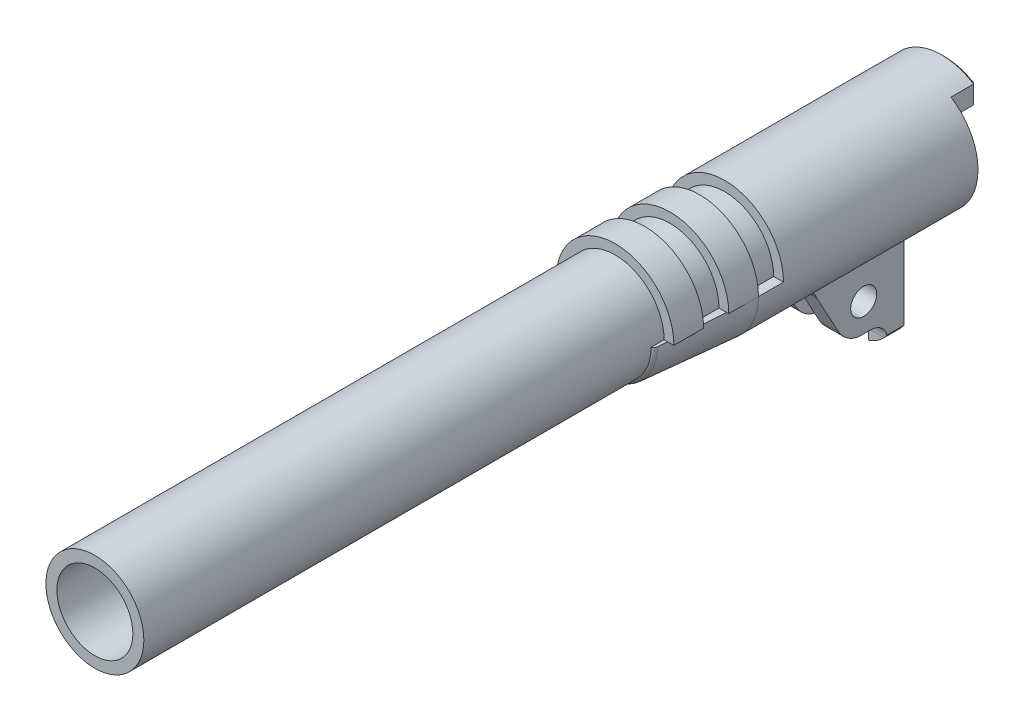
ISO-10303-21;
HEADER;
FILE_DESCRIPTION(('STEP AP214'),'2;1');
FILE_NAME('part.step','',(''),(''),'','','');
FILE_SCHEMA(('AUTOMOTIVE_DESIGN { 1 0 10303 214 1 1 1 1 }'));
ENDSEC;
DATA;
#1=APPLICATION_CONTEXT('core data for automotive mechanical design processes');
#2=APPLICATION_PROTOCOL_DEFINITION('international standard','automotive_design',2000,#1);
#3=PRODUCT_CONTEXT('',#1,'mechanical');
#4=PRODUCT('Part','Part','',(#3));
#5=PRODUCT_RELATED_PRODUCT_CATEGORY('part','',(#4));
#6=PRODUCT_DEFINITION_FORMATION('','',#4);
#7=PRODUCT_DEFINITION_CONTEXT('part definition',#1,'design');
#8=PRODUCT_DEFINITION('design','',#6,#7);
#9=PRODUCT_DEFINITION_SHAPE('','',#8);
#10=(LENGTH_UNIT() NAMED_UNIT(*) SI_UNIT(.MILLI.,.METRE.));
#11=(NAMED_UNIT(*) PLANE_ANGLE_UNIT() SI_UNIT($,.RADIAN.));
#12=(NAMED_UNIT(*) SI_UNIT($,.STERADIAN.) SOLID_ANGLE_UNIT());
#13=UNCERTAINTY_MEASURE_WITH_UNIT(LENGTH_MEASURE(1.E-05),#10,'distance_accuracy_value','');
#14=(GEOMETRIC_REPRESENTATION_CONTEXT(3) GLOBAL_UNCERTAINTY_ASSIGNED_CONTEXT((#13)) GLOBAL_UNIT_ASSIGNED_CONTEXT((#10,
#11,#12)) REPRESENTATION_CONTEXT('',''));
#15=CARTESIAN_POINT('',(0.,0.,0.));
#16=DIRECTION('',(0.,0.,1.));
#17=DIRECTION('',(1.,0.,0.));
#18=AXIS2_PLACEMENT_3D('',#15,#16,#17);
#19=CARTESIAN_POINT('',(4.5974,-8.8392,-41.1607));
#20=DIRECTION('',(0.,0.,-1.));
#21=DIRECTION('',(-1.,0.,0.));
#22=AXIS2_PLACEMENT_3D('',#19,#20,#21);
#23=PLANE('',#22);
#24=DIRECTION('',(0.,-1.,0.));
#25=VECTOR('',#24,1.);
#26=CARTESIAN_POINT('',(-2.00660000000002,-8.8392,-41.1607));
#27=LINE('',#26,#25);
#28=CARTESIAN_POINT('',(-2.00660000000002,-14.1429150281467,-41.1607));
#29=VERTEX_POINT('',#28);
#30=CARTESIAN_POINT('',(-2.00660000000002,-20.5541311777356,-41.1607));
#31=VERTEX_POINT('',#30);
#32=EDGE_CURVE('E633',#29,#31,#27,.T.);
#33=ORIENTED_EDGE('',*,*,#32,.T.);
#34=CARTESIAN_POINT('',(0.,-15.7492997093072,-41.1607));
#35=DIRECTION('',(0.,0.,-1.));
#36=DIRECTION('',(-1.,0.,0.));
#37=AXIS2_PLACEMENT_3D('',#34,#35,#36);
#38=CIRCLE('',#37,5.20699999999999);
#39=CARTESIAN_POINT('',(-4.21639999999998,-18.8045934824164,-41.1607));
#40=VERTEX_POINT('',#39);
#41=EDGE_CURVE('E525',#31,#40,#38,.T.);
#42=ORIENTED_EDGE('',*,*,#41,.T.);
#43=DIRECTION('',(0.,1.,0.));
#44=VECTOR('',#43,1.);
#45=CARTESIAN_POINT('',(-4.21639999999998,-7.54952779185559,-41.1607));
#46=LINE('',#45,#44);
#47=CARTESIAN_POINT('',(-4.21639999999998,-7.76874685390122,-41.1607));
#48=VERTEX_POINT('',#47);
#49=EDGE_CURVE('E630',#40,#48,#46,.T.);
#50=ORIENTED_EDGE('',*,*,#49,.T.);
#51=CARTESIAN_POINT('',(0.,0.,-41.1607));
#52=DIRECTION('',(0.,0.,-1.));
#53=DIRECTION('',(-1.,0.,0.));
#54=AXIS2_PLACEMENT_3D('',#51,#52,#53);
#55=CIRCLE('',#54,8.8392);
#56=CARTESIAN_POINT('',(4.21639999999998,-7.76874685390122,-41.1607));
#57=VERTEX_POINT('',#56);
#58=EDGE_CURVE('E1518',#57,#48,#55,.T.);
#59=ORIENTED_EDGE('',*,*,#58,.F.);
#60=DIRECTION('',(0.,-1.,0.));
#61=VECTOR('',#60,1.);
#62=CARTESIAN_POINT('',(4.21639999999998,-8.8392,-41.1607));
#63=LINE('',#62,#61);
#64=CARTESIAN_POINT('',(4.21639999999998,-18.8045934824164,-41.1607));
#65=VERTEX_POINT('',#64);
#66=EDGE_CURVE('E639',#57,#65,#63,.T.);
#67=ORIENTED_EDGE('',*,*,#66,.T.);
#68=CARTESIAN_POINT('',(0.,-15.7492997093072,-41.1607));
#69=DIRECTION('',(0.,0.,-1.));
#70=DIRECTION('',(-1.,0.,0.));
#71=AXIS2_PLACEMENT_3D('',#68,#69,#70);
#72=CIRCLE('',#71,5.20699999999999);
#73=CARTESIAN_POINT('',(2.0066,-20.5541311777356,-41.1607));
#74=VERTEX_POINT('',#73);
#75=EDGE_CURVE('E586',#65,#74,#72,.T.);
#76=ORIENTED_EDGE('',*,*,#75,.T.);
#77=DIRECTION('',(0.,1.,0.));
#78=VECTOR('',#77,1.);
#79=CARTESIAN_POINT('',(2.0066,-14.1429150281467,-41.1607));
#80=LINE('',#79,#78);
#81=CARTESIAN_POINT('',(2.0066,-14.1429150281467,-41.1607));
#82=VERTEX_POINT('',#81);
#83=EDGE_CURVE('E656',#74,#82,#80,.T.);
#84=ORIENTED_EDGE('',*,*,#83,.T.);
#85=DIRECTION('',(1.,0.,0.));
#86=VECTOR('',#85,1.);
#87=CARTESIAN_POINT('',(-1.7526,-14.1429150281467,-41.1607));
#88=LINE('',#87,#86);
#89=EDGE_CURVE('E666',#29,#82,#88,.T.);
#90=ORIENTED_EDGE('',*,*,#89,.F.);
#91=EDGE_LOOP('',(#33,#42,#50,#59,#67,#76,#84,#90));
#92=FACE_BOUND('',#91,.T.);
#93=ADVANCED_FACE('F50',(#92),#23,.T.);
#94=CARTESIAN_POINT('',(4.5974,-19.558,-35.7886));
#95=DIRECTION('',(1.,0.,0.));
#96=DIRECTION('',(0.,0.,-1.));
#97=AXIS2_PLACEMENT_3D('',#94,#95,#96);
#98=PLANE('',#97);
#99=CARTESIAN_POINT('',(4.5974,-12.7762,-34.7472));
#100=DIRECTION('',(1.,0.,0.));
#101=DIRECTION('',(0.,0.,-1.));
#102=AXIS2_PLACEMENT_3D('',#99,#100,#101);
#103=CIRCLE('',#102,1.9558);
#104=CARTESIAN_POINT('',(4.5974,-12.7762,-36.703));
#105=VERTEX_POINT('',#104);
#106=EDGE_CURVE('E700',#105,#105,#103,.T.);
#107=ORIENTED_EDGE('',*,*,#106,.F.);
#108=EDGE_LOOP('',(#107));
#109=FACE_BOUND('',#108,.T.);
#110=DIRECTION('',(0.,0.,1.));
#111=VECTOR('',#110,1.);
#112=CARTESIAN_POINT('',(4.5974,-18.9257217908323,-51.485825));
#113=LINE('',#112,#111);
#114=CARTESIAN_POINT('',(4.5974,-18.9257217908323,-40.7797));
#115=VERTEX_POINT('',#114);
#116=CARTESIAN_POINT('',(4.5974,-18.9257217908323,-38.248645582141));
#117=VERTEX_POINT('',#116);
#118=EDGE_CURVE('E361',#115,#117,#113,.T.);
#119=ORIENTED_EDGE('',*,*,#118,.F.);
#120=DIRECTION('',(0.,1.,0.));
#121=VECTOR('',#120,1.);
#122=CARTESIAN_POINT('',(4.5974,-19.558,-40.7797));
#123=LINE('',#122,#121);
#124=CARTESIAN_POINT('',(4.5974,-7.54952779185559,-40.7797));
#125=VERTEX_POINT('',#124);
#126=EDGE_CURVE('E640',#115,#125,#123,.T.);
#127=ORIENTED_EDGE('',*,*,#126,.T.);
#128=DIRECTION('',(0.,0.,1.));
#129=VECTOR('',#128,1.);
#130=CARTESIAN_POINT('',(4.5974,-7.54952779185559,-51.4858));
#131=LINE('',#130,#129);
#132=CARTESIAN_POINT('',(4.5974,-7.54952779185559,-26.1722076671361));
#133=VERTEX_POINT('',#132);
#134=EDGE_CURVE('E686',#133,#125,#131,.F.);
#135=ORIENTED_EDGE('',*,*,#134,.F.);
#136=CARTESIAN_POINT('',(0.,-8.8392,-27.6961606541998));
#137=CARTESIAN_POINT('',(0.,-8.8392,-27.6961606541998));
#138=CARTESIAN_POINT('',(0.,-8.8392,-27.6961606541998));
#139=CARTESIAN_POINT('',(0.00540470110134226,-8.83919999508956,-27.6937307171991));
#140=CARTESIAN_POINT('',(0.00587060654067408,-8.83920018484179,-27.6949456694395));
#141=CARTESIAN_POINT('',(0.00633654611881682,-8.8392,-27.6961606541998));
#142=CARTESIAN_POINT('',(0.010809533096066,-8.83919503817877,-27.6913007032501));
#143=CARTESIAN_POINT('',(0.0117413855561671,-8.83919436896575,-27.6937306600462));
#144=CARTESIAN_POINT('',(0.0126732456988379,-8.8392,-27.6961606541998));
#145=CARTESIAN_POINT('',(0.454711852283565,-8.83838114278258,-27.4917221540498));
#146=CARTESIAN_POINT('',(0.493996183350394,-8.83822467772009,-27.5939271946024));
#147=CARTESIAN_POINT('',(0.533110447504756,-8.8392,-27.6961606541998));
#148=CARTESIAN_POINT('',(0.894033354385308,-8.80497658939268,-27.2942075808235));
#149=CARTESIAN_POINT('',(0.978138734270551,-8.79753447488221,-27.4940083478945));
#150=CARTESIAN_POINT('',(1.04817703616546,-8.8392,-27.6961606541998));
#151=CARTESIAN_POINT('',(1.55108589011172,-8.70489000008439,-27.0138784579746));
#152=CARTESIAN_POINT('',(1.67862387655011,-8.68269818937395,-27.375082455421));
#153=CARTESIAN_POINT('',(1.81851449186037,-8.8392,-27.6961606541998));
#154=CARTESIAN_POINT('',(1.7704664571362,-8.66298714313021,-26.9228324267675));
#155=CARTESIAN_POINT('',(1.91372746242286,-8.63396807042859,-27.3398353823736));
#156=CARTESIAN_POINT('',(2.07571929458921,-8.8392,-27.6961606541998));
#157=CARTESIAN_POINT('',(2.20782887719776,-8.56196547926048,-26.7495540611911));
#158=CARTESIAN_POINT('',(2.37580012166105,-8.51900475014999,-27.285091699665));
#159=CARTESIAN_POINT('',(2.58848902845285,-8.8392,-27.6961606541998));
#160=CARTESIAN_POINT('',(2.42581130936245,-8.50285434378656,-26.6673178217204));
#161=CARTESIAN_POINT('',(2.60451078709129,-8.45187448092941,-27.2657399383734));
#162=CARTESIAN_POINT('',(2.84405463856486,-8.8392,-27.6961606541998));
#163=CARTESIAN_POINT('',(2.82218064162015,-8.37867213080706,-26.5289183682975));
#164=CARTESIAN_POINT('',(3.01019173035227,-8.31549553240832,-27.2514198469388));
#165=CARTESIAN_POINT('',(3.30876351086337,-8.8392,-27.6961606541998));
#166=CARTESIAN_POINT('',(3.00091882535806,-8.3163825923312,-26.4707041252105));
#167=CARTESIAN_POINT('',(3.19126013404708,-8.24752731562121,-27.2532339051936));
#168=CARTESIAN_POINT('',(3.51831862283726,-8.8392,-27.6961606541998));
#169=CARTESIAN_POINT('',(3.35637150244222,-8.17939523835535,-26.3662705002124));
#170=CARTESIAN_POINT('',(3.54177832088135,-8.10327921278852,-27.2779884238));
#171=CARTESIAN_POINT('',(3.93505624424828,-8.8392,-27.6961606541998));
#172=CARTESIAN_POINT('',(3.53308487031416,-8.10469084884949,-26.3200575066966));
#173=CARTESIAN_POINT('',(3.71199747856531,-8.02619403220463,-27.3018023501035));
#174=CARTESIAN_POINT('',(4.14223743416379,-8.8392,-27.6961606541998));
#175=CARTESIAN_POINT('',(3.88116300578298,-7.94382189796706,-26.2443114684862));
#176=CARTESIAN_POINT('',(4.03278879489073,-7.86942270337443,-27.3767452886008));
#177=CARTESIAN_POINT('',(4.55032904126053,-8.8392,-27.6961606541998));
#178=CARTESIAN_POINT('',(4.05256726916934,-7.85781604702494,-26.2145727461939));
#179=CARTESIAN_POINT('',(4.18408545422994,-7.78898297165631,-27.429088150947));
#180=CARTESIAN_POINT('',(4.75128576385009,-8.8392,-27.6961606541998));
#181=CARTESIAN_POINT('',(4.39059438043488,-7.67404952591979,-26.1764244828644));
#182=CARTESIAN_POINT('',(4.46007742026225,-7.63346577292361,-27.5684503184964));
#183=CARTESIAN_POINT('',(5.14759341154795,-8.8392,-27.6961606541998));
#184=CARTESIAN_POINT('',(4.5572244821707,-7.57630800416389,-26.1679806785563));
#185=CARTESIAN_POINT('',(4.58444171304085,-7.5580260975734,-27.6580445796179));
#186=CARTESIAN_POINT('',(5.34295284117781,-8.8392,-27.6961606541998));
#187=CARTESIAN_POINT('',(4.85646640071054,-7.38729079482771,-26.1792597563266));
#188=CARTESIAN_POINT('',(4.77217698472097,-7.44150016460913,-27.8591169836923));
#189=CARTESIAN_POINT('',(5.69378819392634,-8.8392,-27.6961606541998));
#190=CARTESIAN_POINT('',(4.99015304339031,-7.29761133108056,-26.1945629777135));
#191=CARTESIAN_POINT('',(4.84170337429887,-7.39695956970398,-27.9680733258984));
#192=CARTESIAN_POINT('',(5.8505242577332,-8.8392,-27.6961606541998));
#193=CARTESIAN_POINT('',(5.18558952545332,-7.15874483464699,-26.2378431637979));
#194=CARTESIAN_POINT('',(4.90979429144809,-7.35798648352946,-28.1492691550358));
#195=CARTESIAN_POINT('',(6.07965668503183,-8.8392,-27.6961606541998));
#196=CARTESIAN_POINT('',(5.2502716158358,-7.11142369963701,-26.2558339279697));
#197=CARTESIAN_POINT('',(4.92643846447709,-7.34980784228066,-28.2151635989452));
#198=CARTESIAN_POINT('',(6.15549085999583,-8.8392,-27.6961606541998));
#199=CARTESIAN_POINT('',(5.37720748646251,-7.01594388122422,-26.2998598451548));
#200=CARTESIAN_POINT('',(4.94419311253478,-7.34711344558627,-28.3520147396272));
#201=CARTESIAN_POINT('',(6.30431222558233,-8.8392,-27.6961606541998));
#202=CARTESIAN_POINT('',(5.43945507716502,-6.96778346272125,-26.3259141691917));
#203=CARTESIAN_POINT('',(4.94464690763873,-7.35318175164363,-28.4232568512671));
#204=CARTESIAN_POINT('',(6.37729215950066,-8.8392,-27.6961606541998));
#205=CARTESIAN_POINT('',(5.50012517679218,-6.91954331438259,-26.3565405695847));
#206=CARTESIAN_POINT('',(4.93539526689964,-7.36842918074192,-28.4939309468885));
#207=CARTESIAN_POINT('',(6.44842262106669,-8.8392,-27.6961606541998));
#208=(BOUNDED_SURFACE() B_SPLINE_SURFACE(3,2,((#136,#137,#138),(#139,#140,#141),(#142,#143,
#144),(#145,#146,#147),(#148,#149,#150),(#151,#152,#153),(#154,#155,#156),(#157,#158,#159),
(#160,#161,#162),(#163,#164,#165),(#166,#167,#168),(#169,#170,#171),(#172,#173,#174),(#175,#176,
#177),(#178,#179,#180),(#181,#182,#183),(#184,#185,#186),(#187,#188,#189),(#190,#191,#192),
(#193,#194,#195),(#196,#197,#198),(#199,#200,#201),(#202,#203,#204),(#205,#206,#207)),
.UNSPECIFIED.,.F.,.F.,.F.) B_SPLINE_SURFACE_WITH_KNOTS((4,2,2,2,2,2,2,2,2,2,2,4),(3,3),(0.,
0.020359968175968,1.67213850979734,2.50325532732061,3.33400219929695,4.02161796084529,
4.70959900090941,5.38878516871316,6.06687783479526,6.63303070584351,6.91969079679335,
7.20703772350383),(0.,1.),
.UNSPECIFIED.) GEOMETRIC_REPRESENTATION_ITEM() RATIONAL_B_SPLINE_SURFACE(((1.,1.,1.),(1.,
0.999999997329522,1.),(1.,0.999998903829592,1.),(1.,0.999819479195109,1.),(1.,0.992460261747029,
1.),(1.,0.970324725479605,1.),(1.,0.961050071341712,1.),(1.,0.938636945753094,1.),(1.,
0.92550019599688,1.),(1.,0.897806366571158,1.),(1.,0.883883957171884,1.),(1.,0.853147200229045,
1.),(1.,0.836331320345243,1.),(1.,0.799925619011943,1.),(1.,0.780374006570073,1.),(1.,
0.738287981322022,1.),(1.,0.715758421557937,1.),(1.,0.671719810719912,1.),(1.,0.650656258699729,
1.),(1.,0.617633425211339,1.),(1.,0.606313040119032,1.),(1.,0.583303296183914,1.),(1.,
0.57161311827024,1.),(1.,0.559801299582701,1.))) REPRESENTATION_ITEM('') SURFACE());
#209=CARTESIAN_POINT('',(4.5974,-7.54952779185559,-26.1722076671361));
#210=CARTESIAN_POINT('',(4.5974,-7.54951766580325,-26.2113785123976));
#211=CARTESIAN_POINT('',(4.5974,-7.55129510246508,-26.2505443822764));
#212=CARTESIAN_POINT('',(4.5974,-7.55834883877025,-26.3285409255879));
#213=CARTESIAN_POINT('',(4.5974,-7.56362340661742,-26.3673717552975));
#214=CARTESIAN_POINT('',(4.5974,-7.57755174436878,-26.4441722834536));
#215=CARTESIAN_POINT('',(4.5974,-7.58618425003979,-26.4821458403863));
#216=CARTESIAN_POINT('',(4.5974,-7.60667820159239,-26.5572029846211));
#217=CARTESIAN_POINT('',(4.5974,-7.61853987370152,-26.5942865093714));
#218=CARTESIAN_POINT('',(4.5974,-7.65867921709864,-26.7036986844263));
#219=CARTESIAN_POINT('',(4.5974,-7.69154871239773,-26.7743893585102));
#220=CARTESIAN_POINT('',(4.5974,-7.76775078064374,-26.9098850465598));
#221=CARTESIAN_POINT('',(4.5974,-7.81109712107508,-26.974682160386));
#222=CARTESIAN_POINT('',(4.5974,-7.91054191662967,-27.1028546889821));
#223=CARTESIAN_POINT('',(4.5974,-7.96741847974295,-27.1656237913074));
#224=CARTESIAN_POINT('',(4.5974,-8.08926175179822,-27.282771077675));
#225=CARTESIAN_POINT('',(4.5974,-8.15423641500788,-27.3371408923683));
#226=CARTESIAN_POINT('',(4.5974,-8.30474927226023,-27.4475692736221));
#227=CARTESIAN_POINT('',(4.5974,-8.39175411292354,-27.5016284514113));
#228=CARTESIAN_POINT('',(4.5974,-8.57257775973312,-27.59643900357));
#229=CARTESIAN_POINT('',(4.5974,-8.66638578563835,-27.6372108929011));
#230=CARTESIAN_POINT('',(4.5974,-8.78795352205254,-27.6798386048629));
#231=CARTESIAN_POINT('',(4.5974,-8.81350409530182,-27.6882491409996));
#232=CARTESIAN_POINT('',(4.5974,-8.8392,-27.6961606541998));
#233=B_SPLINE_CURVE_WITH_KNOTS('',3,(#209,#210,#211,#212,#213,#214,#215,#216,#217,#218,#219,
#220,#221,#222,#223,#224,#225,#226,#227,#228,#229,#230,#231,#232),.UNSPECIFIED.,.F.,.F.,(4,2,2,
2,2,2,2,2,2,2,2,4),(0.,0.11746404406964,0.234869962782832,0.35154420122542,0.468226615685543,
0.70098762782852,0.934056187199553,1.18725761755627,1.44070974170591,1.74686044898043,
2.05253620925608,2.13321227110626),.UNSPECIFIED.);
#234=CARTESIAN_POINT('',(4.5974,-8.8392,-27.6961606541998));
#235=VERTEX_POINT('',#234);
#236=EDGE_CURVE('E581',#133,#235,#233,.T.);
#237=ORIENTED_EDGE('',*,*,#236,.T.);
#238=DIRECTION('',(0.,-0.878817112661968,-0.477158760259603));
#239=VECTOR('',#238,1.);
#240=CARTESIAN_POINT('',(4.5974,-8.8392,-27.6961606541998));
#241=LINE('',#240,#239);
#242=CARTESIAN_POINT('',(4.5974,-14.836571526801,-30.9524677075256));
#243=VERTEX_POINT('',#242);
#244=EDGE_CURVE('E1551',#235,#243,#241,.T.);
#245=ORIENTED_EDGE('',*,*,#244,.T.);
#246=CARTESIAN_POINT('',(4.5974,-12.7762,-34.7472));
#247=DIRECTION('',(1.,0.,0.));
#248=DIRECTION('',(0.,0.,-1.));
#249=AXIS2_PLACEMENT_3D('',#246,#247,#248);
#250=CIRCLE('',#249,4.318);
#251=CARTESIAN_POINT('',(4.5974,-17.018,-33.9395758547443));
#252=VERTEX_POINT('',#251);
#253=EDGE_CURVE('E1553',#243,#252,#250,.T.);
#254=ORIENTED_EDGE('',*,*,#253,.T.);
#255=DIRECTION('',(0.,0.,-1.));
#256=VECTOR('',#255,1.);
#257=CARTESIAN_POINT('',(4.5974,-17.018,-33.9395758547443));
#258=LINE('',#257,#256);
#259=CARTESIAN_POINT('',(4.5974,-17.018,-35.7886));
#260=VERTEX_POINT('',#259);
#261=EDGE_CURVE('E1555',#252,#260,#258,.T.);
#262=ORIENTED_EDGE('',*,*,#261,.T.);
#263=CARTESIAN_POINT('',(4.5974,-19.558,-35.7886));
#264=DIRECTION('',(1.,0.,0.));
#265=DIRECTION('',(0.,0.,-1.));
#266=AXIS2_PLACEMENT_3D('',#263,#264,#265);
#267=CIRCLE('',#266,2.54);
#268=EDGE_CURVE('E1542',#117,#260,#267,.T.);
#269=ORIENTED_EDGE('',*,*,#268,.F.);
#270=EDGE_LOOP('',(#119,#127,#135,#237,#245,#254,#262,#269));
#271=FACE_BOUND('',#270,.T.);
#272=ADVANCED_FACE('F571',(#109,#271),#98,.T.);
#273=CARTESIAN_POINT('',(4.5974,-19.558,-35.7886));
#274=DIRECTION('',(-1.,0.,0.));
#275=DIRECTION('',(0.,0.,1.));
#276=AXIS2_PLACEMENT_3D('',#273,#274,#275);
#277=CYLINDRICAL_SURFACE('',#276,2.54);
#278=DIRECTION('',(-1.,0.,0.));
#279=VECTOR('',#278,1.);
#280=CARTESIAN_POINT('',(4.5974,-19.558,-38.3286));
#281=LINE('',#280,#279);
#282=CARTESIAN_POINT('',(4.08895415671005,-19.558,-38.3286));
#283=VERTEX_POINT('',#282);
#284=CARTESIAN_POINT('',(1.7526,-19.558,-38.3286));
#285=VERTEX_POINT('',#284);
#286=EDGE_CURVE('E1524',#283,#285,#281,.T.);
#287=ORIENTED_EDGE('',*,*,#286,.F.);
#288=CARTESIAN_POINT('',(1.7526,-21.0553469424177,-37.8403193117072));
#289=CARTESIAN_POINT('',(1.90311786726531,-21.0055959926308,-37.8766434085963));
#290=CARTESIAN_POINT('',(2.05114268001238,-20.9496308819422,-37.9146994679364));
#291=CARTESIAN_POINT('',(2.34217843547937,-20.8252376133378,-37.9911051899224));
#292=CARTESIAN_POINT('',(2.48517795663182,-20.7567830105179,-38.0294553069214));
#293=CARTESIAN_POINT('',(2.76792490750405,-20.60629268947,-38.1037355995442));
#294=CARTESIAN_POINT('',(2.90757252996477,-20.5240414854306,-38.1396120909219));
#295=CARTESIAN_POINT('',(3.18009134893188,-20.3470348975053,-38.2047785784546));
#296=CARTESIAN_POINT('',(3.3129702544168,-20.2522942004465,-38.2340762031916));
#297=CARTESIAN_POINT('',(3.60236811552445,-20.0259736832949,-38.2884402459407));
#298=CARTESIAN_POINT('',(3.75685467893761,-19.8910208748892,-38.3107799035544));
#299=CARTESIAN_POINT('',(3.97668730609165,-19.6764018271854,-38.3268422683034));
#300=CARTESIAN_POINT('',(4.04773641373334,-19.6031291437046,-38.3293116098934));
#301=CARTESIAN_POINT('',(4.18566277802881,-19.4528583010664,-38.3275338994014));
#302=CARTESIAN_POINT('',(4.25254263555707,-19.375862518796,-38.3232910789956));
#303=CARTESIAN_POINT('',(4.36663131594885,-19.2370445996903,-38.3089691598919));
#304=CARTESIAN_POINT('',(4.41480290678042,-19.1758485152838,-38.300473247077));
#305=CARTESIAN_POINT('',(4.50833391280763,-19.0518374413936,-38.2784562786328));
#306=CARTESIAN_POINT('',(4.55368131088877,-18.9890169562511,-38.2649152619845));
#307=CARTESIAN_POINT('',(4.5974,-18.9257217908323,-38.248645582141));
#308=B_SPLINE_CURVE_WITH_KNOTS('',3,(#288,#289,#290,#291,#292,#293,#294,#295,#296,#297,#298,
#299,#300,#301,#302,#303,#304,#305,#306,#307),.UNSPECIFIED.,.F.,.F.,(4,2,2,2,2,2,2,2,2,4),(0.,
0.487739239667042,0.976523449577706,1.47380812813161,1.97051316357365,2.58707030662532,
2.89305213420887,3.19884113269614,3.43365559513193,3.6694091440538),.UNSPECIFIED.);
#309=EDGE_CURVE('E755',#283,#117,#308,.T.);
#310=ORIENTED_EDGE('',*,*,#309,.T.);
#311=ORIENTED_EDGE('',*,*,#268,.T.);
#312=DIRECTION('',(-1.,0.,0.));
#313=VECTOR('',#312,1.);
#314=CARTESIAN_POINT('',(4.5974,-17.018,-35.7886));
#315=LINE('',#314,#313);
#316=CARTESIAN_POINT('',(1.7526,-17.018,-35.7886));
#317=VERTEX_POINT('',#316);
#318=EDGE_CURVE('E1528',#260,#317,#315,.T.);
#319=ORIENTED_EDGE('',*,*,#318,.T.);
#320=CARTESIAN_POINT('',(1.7526,-19.558,-35.7886));
#321=DIRECTION('',(1.,0.,0.));
#322=DIRECTION('',(0.,0.,-1.));
#323=AXIS2_PLACEMENT_3D('',#320,#321,#322);
#324=CIRCLE('',#323,2.54);
#325=EDGE_CURVE('E1580',#285,#317,#324,.T.);
#326=ORIENTED_EDGE('',*,*,#325,.F.);
#327=EDGE_LOOP('',(#287,#310,#311,#319,#326));
#328=FACE_BOUND('',#327,.T.);
#329=ADVANCED_FACE('F575',(#328),#277,.F.);
#330=CARTESIAN_POINT('',(4.5974,-21.336,-38.3286));
#331=DIRECTION('',(0.,0.,1.));
#332=DIRECTION('',(1.,0.,0.));
#333=AXIS2_PLACEMENT_3D('',#330,#331,#332);
#334=PLANE('',#333);
#335=DIRECTION('',(0.,1.,0.));
#336=VECTOR('',#335,1.);
#337=CARTESIAN_POINT('',(1.7526,-21.336,-38.3286));
#338=LINE('',#337,#336);
#339=CARTESIAN_POINT('',(1.7526,-21.0553469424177,-38.3286));
#340=VERTEX_POINT('',#339);
#341=EDGE_CURVE('E696',#340,#285,#338,.T.);
#342=ORIENTED_EDGE('',*,*,#341,.F.);
#343=CARTESIAN_POINT('',(0.,-15.7492997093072,-38.3286));
#344=DIRECTION('',(0.,0.,1.));
#345=DIRECTION('',(1.,0.,0.));
#346=AXIS2_PLACEMENT_3D('',#343,#344,#345);
#347=CIRCLE('',#346,5.588);
#348=EDGE_CURVE('E763',#340,#283,#347,.T.);
#349=ORIENTED_EDGE('',*,*,#348,.T.);
#350=ORIENTED_EDGE('',*,*,#286,.T.);
#351=EDGE_LOOP('',(#342,#349,#350));
#352=FACE_BOUND('',#351,.T.);
#353=ADVANCED_FACE('F556',(#352),#334,.T.);
#354=CARTESIAN_POINT('',(1.7526,-19.8374,-31.6033512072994));
#355=DIRECTION('',(1.,0.,0.));
#356=DIRECTION('',(0.,0.,-1.));
#357=AXIS2_PLACEMENT_3D('',#354,#355,#356);
#358=PLANE('',#357);
#359=CARTESIAN_POINT('',(1.7526,-12.7762,-34.7472));
#360=DIRECTION('',(1.,0.,0.));
#361=DIRECTION('',(0.,0.,-1.));
#362=AXIS2_PLACEMENT_3D('',#359,#360,#361);
#363=CIRCLE('',#362,1.9558);
#364=CARTESIAN_POINT('',(1.7526,-12.7762,-36.703));
#365=VERTEX_POINT('',#364);
#366=EDGE_CURVE('E693',#365,#365,#363,.F.);
#367=ORIENTED_EDGE('',*,*,#366,.F.);
#368=EDGE_LOOP('',(#367));
#369=FACE_BOUND('',#368,.T.);
#370=DIRECTION('',(0.,-1.,0.));
#371=VECTOR('',#370,1.);
#372=CARTESIAN_POINT('',(1.7526,-21.0553469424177,-40.9067));
#373=LINE('',#372,#371);
#374=CARTESIAN_POINT('',(1.7526,-13.736762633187,-40.9067));
#375=VERTEX_POINT('',#374);
#376=CARTESIAN_POINT('',(1.7526,-20.9214283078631,-40.9067));
#377=VERTEX_POINT('',#376);
#378=EDGE_CURVE('E653',#375,#377,#373,.T.);
#379=ORIENTED_EDGE('',*,*,#378,.T.);
#380=CARTESIAN_POINT('',(1.7526,-20.9214283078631,-40.9067));
#381=CARTESIAN_POINT('',(1.7526,-20.9437616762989,-40.8855476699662));
#382=CARTESIAN_POINT('',(1.7526,-20.9660882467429,-40.8643881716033));
#383=CARTESIAN_POINT('',(1.7526,-21.0107277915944,-40.8220548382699));
#384=CARTESIAN_POINT('',(1.7526,-21.0330407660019,-40.8008810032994));
#385=CARTESIAN_POINT('',(1.7526,-21.0553469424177,-40.7797));
#386=B_SPLINE_CURVE_WITH_KNOTS('',3,(#380,#381,#382,#383,#384,#385),.UNSPECIFIED.,.F.,.F.,(4,2,
4),(0.,0.092281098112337,0.184562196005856),.UNSPECIFIED.);
#387=CARTESIAN_POINT('',(1.7526,-21.0553469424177,-40.7797));
#388=VERTEX_POINT('',#387);
#389=EDGE_CURVE('E77',#377,#388,#386,.T.);
#390=ORIENTED_EDGE('',*,*,#389,.T.);
#391=DIRECTION('',(0.,0.,1.));
#392=VECTOR('',#391,1.);
#393=CARTESIAN_POINT('',(1.7526,-21.0553469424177,-51.485825));
#394=LINE('',#393,#392);
#395=EDGE_CURVE('E645',#340,#388,#394,.F.);
#396=ORIENTED_EDGE('',*,*,#395,.F.);
#397=ORIENTED_EDGE('',*,*,#341,.T.);
#398=ORIENTED_EDGE('',*,*,#325,.T.);
#399=DIRECTION('',(0.,0.,-1.));
#400=VECTOR('',#399,1.);
#401=CARTESIAN_POINT('',(1.7526,-17.018,-33.9395758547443));
#402=LINE('',#401,#400);
#403=CARTESIAN_POINT('',(1.7526,-17.018,-33.9395758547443));
#404=VERTEX_POINT('',#403);
#405=EDGE_CURVE('E1577',#404,#317,#402,.T.);
#406=ORIENTED_EDGE('',*,*,#405,.F.);
#407=CARTESIAN_POINT('',(1.7526,-12.7762,-34.7472));
#408=DIRECTION('',(1.,0.,0.));
#409=DIRECTION('',(0.,0.,-1.));
#410=AXIS2_PLACEMENT_3D('',#407,#408,#409);
#411=CIRCLE('',#410,4.318);
#412=CARTESIAN_POINT('',(1.7526,-14.836571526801,-30.9524677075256));
#413=VERTEX_POINT('',#412);
#414=EDGE_CURVE('E1574',#413,#404,#411,.T.);
#415=ORIENTED_EDGE('',*,*,#414,.F.);
#416=DIRECTION('',(0.,-0.878817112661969,-0.477158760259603));
#417=VECTOR('',#416,1.);
#418=CARTESIAN_POINT('',(1.7526,-8.8392,-27.6961606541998));
#419=LINE('',#418,#417);
#420=CARTESIAN_POINT('',(1.7526,-9.32560076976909,-27.9602547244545));
#421=VERTEX_POINT('',#420);
#422=EDGE_CURVE('E692',#421,#413,#419,.T.);
#423=ORIENTED_EDGE('',*,*,#422,.F.);
#424=CARTESIAN_POINT('',(1.7526,-19.8374,-31.6033512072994));
#425=DIRECTION('',(1.,0.,0.));
#426=DIRECTION('',(0.,0.,-1.));
#427=AXIS2_PLACEMENT_3D('',#424,#425,#426);
#428=CIRCLE('',#427,11.1252);
#429=EDGE_CURVE('E1584',#375,#421,#428,.T.);
#430=ORIENTED_EDGE('',*,*,#429,.F.);
#431=EDGE_LOOP('',(#379,#390,#396,#397,#398,#406,#415,#423,#430));
#432=FACE_BOUND('',#431,.T.);
#433=ADVANCED_FACE('F551',(#369,#432),#358,.F.);
#434=CARTESIAN_POINT('',(-4.5974,-19.558,-35.7886));
#435=DIRECTION('',(1.,0.,0.));
#436=DIRECTION('',(0.,0.,-1.));
#437=AXIS2_PLACEMENT_3D('',#434,#435,#436);
#438=CIRCLE('',#437,2.54);
#439=CARTESIAN_POINT('',(-4.5974,-18.9257217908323,-38.248645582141));
#440=VERTEX_POINT('',#439);
#441=CARTESIAN_POINT('',(-4.5974,-17.018,-35.7886));
#442=VERTEX_POINT('',#441);
#443=EDGE_CURVE('E1549',#440,#442,#438,.T.);
#444=ORIENTED_EDGE('',*,*,#443,.F.);
#445=CARTESIAN_POINT('',(-4.5974,-18.9257217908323,-38.248645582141));
#446=CARTESIAN_POINT('',(-4.53647891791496,-19.0139682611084,-38.2713298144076));
#447=CARTESIAN_POINT('',(-4.47238460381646,-19.1012364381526,-38.2886983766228));
#448=CARTESIAN_POINT('',(-4.33868272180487,-19.2725407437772,-38.3139872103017));
#449=CARTESIAN_POINT('',(-4.26908922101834,-19.3565843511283,-38.3219308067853));
#450=CARTESIAN_POINT('',(-4.12583226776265,-19.5195668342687,-38.3296039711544));
#451=CARTESIAN_POINT('',(-4.05223200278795,-19.5985571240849,-38.3294369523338));
#452=CARTESIAN_POINT('',(-3.90071111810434,-19.7520275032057,-38.3223438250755));
#453=CARTESIAN_POINT('',(-3.82278750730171,-19.8265043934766,-38.3154129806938));
#454=CARTESIAN_POINT('',(-3.64243032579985,-19.9892024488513,-38.2934037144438));
#455=CARTESIAN_POINT('',(-3.53888633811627,-20.075971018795,-38.2766770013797));
#456=CARTESIAN_POINT('',(-3.32667161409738,-20.2411934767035,-38.2364731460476));
#457=CARTESIAN_POINT('',(-3.21799978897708,-20.319645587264,-38.2129945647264));
#458=CARTESIAN_POINT('',(-2.88415015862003,-20.5429721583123,-38.1351576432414));
#459=CARTESIAN_POINT('',(-2.6519535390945,-20.675086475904,-38.0735285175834));
#460=CARTESIAN_POINT('',(-2.30502385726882,-20.8411362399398,-37.981456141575));
#461=CARTESIAN_POINT('',(-2.196207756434,-20.889008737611,-37.9525784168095));
#462=CARTESIAN_POINT('',(-1.9762703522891,-20.9774932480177,-37.8955862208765));
#463=CARTESIAN_POINT('',(-1.86516677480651,-21.0181470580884,-37.8674682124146));
#464=CARTESIAN_POINT('',(-1.7526,-21.0553469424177,-37.8403193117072));
#465=B_SPLINE_CURVE_WITH_KNOTS('',3,(#445,#446,#447,#448,#449,#450,#451,#452,#453,#454,#455,
#456,#457,#458,#459,#460,#461,#462,#463,#464),.UNSPECIFIED.,.F.,.F.,(4,2,2,2,2,2,2,2,2,4),(0.,
0.328461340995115,0.656108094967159,0.979578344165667,1.3032752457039,1.71102269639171,
2.11885711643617,2.93779532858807,3.30464659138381,3.66929906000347),.UNSPECIFIED.);
#466=CARTESIAN_POINT('',(-4.08895415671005,-19.558,-38.3286));
#467=VERTEX_POINT('',#466);
#468=EDGE_CURVE('E748',#440,#467,#465,.T.);
#469=ORIENTED_EDGE('',*,*,#468,.T.);
#470=CARTESIAN_POINT('',(-1.7526,-19.558,-38.3286));
#471=VERTEX_POINT('',#470);
#472=EDGE_CURVE('E1527',#471,#467,#281,.T.);
#473=ORIENTED_EDGE('',*,*,#472,.F.);
#474=CARTESIAN_POINT('',(-1.7526,-19.558,-35.7886));
#475=DIRECTION('',(1.,0.,0.));
#476=DIRECTION('',(0.,0.,-1.));
#477=AXIS2_PLACEMENT_3D('',#474,#475,#476);
#478=CIRCLE('',#477,2.54);
#479=CARTESIAN_POINT('',(-1.7526,-17.018,-35.7886));
#480=VERTEX_POINT('',#479);
#481=EDGE_CURVE('E1568',#471,#480,#478,.T.);
#482=ORIENTED_EDGE('',*,*,#481,.T.);
#483=EDGE_CURVE('E1526',#480,#442,#315,.T.);
#484=ORIENTED_EDGE('',*,*,#483,.T.);
#485=EDGE_LOOP('',(#444,#469,#473,#482,#484));
#486=FACE_BOUND('',#485,.T.);
#487=ADVANCED_FACE('F555',(#486),#277,.F.);
#488=ORIENTED_EDGE('',*,*,#472,.T.);
#489=CARTESIAN_POINT('',(0.,-15.7492997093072,-38.3286));
#490=DIRECTION('',(0.,0.,1.));
#491=DIRECTION('',(1.,0.,0.));
#492=AXIS2_PLACEMENT_3D('',#489,#490,#491);
#493=CIRCLE('',#492,5.588);
#494=CARTESIAN_POINT('',(-1.7526,-21.0553469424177,-38.3286));
#495=VERTEX_POINT('',#494);
#496=EDGE_CURVE('E1600',#467,#495,#493,.T.);
#497=ORIENTED_EDGE('',*,*,#496,.T.);
#498=DIRECTION('',(0.,1.,0.));
#499=VECTOR('',#498,1.);
#500=CARTESIAN_POINT('',(-1.7526,-21.336,-38.3286));
#501=LINE('',#500,#499);
#502=EDGE_CURVE('E682',#495,#471,#501,.T.);
#503=ORIENTED_EDGE('',*,*,#502,.T.);
#504=EDGE_LOOP('',(#488,#497,#503));
#505=FACE_BOUND('',#504,.T.);
#506=ADVANCED_FACE('F742',(#505),#334,.T.);
#507=CARTESIAN_POINT('',(-4.5974,-19.558,-35.7886));
#508=DIRECTION('',(1.,0.,0.));
#509=DIRECTION('',(0.,0.,-1.));
#510=AXIS2_PLACEMENT_3D('',#507,#508,#509);
#511=PLANE('',#510);
#512=CARTESIAN_POINT('',(-4.5974,-12.7762,-34.7472));
#513=DIRECTION('',(1.,0.,0.));
#514=DIRECTION('',(0.,0.,-1.));
#515=AXIS2_PLACEMENT_3D('',#512,#513,#514);
#516=CIRCLE('',#515,1.9558);
#517=CARTESIAN_POINT('',(-4.5974,-12.7762,-36.703));
#518=VERTEX_POINT('',#517);
#519=EDGE_CURVE('E697',#518,#518,#516,.T.);
#520=ORIENTED_EDGE('',*,*,#519,.T.);
#521=EDGE_LOOP('',(#520));
#522=FACE_BOUND('',#521,.T.);
#523=DIRECTION('',(0.,0.,1.));
#524=VECTOR('',#523,1.);
#525=CARTESIAN_POINT('',(-4.5974,-7.54952779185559,-51.4858));
#526=LINE('',#525,#524);
#527=CARTESIAN_POINT('',(-4.5974,-7.54952779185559,-26.1722076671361));
#528=VERTEX_POINT('',#527);
#529=CARTESIAN_POINT('',(-4.5974,-7.54952779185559,-40.7797));
#530=VERTEX_POINT('',#529);
#531=EDGE_CURVE('E703',#528,#530,#526,.F.);
#532=ORIENTED_EDGE('',*,*,#531,.T.);
#533=DIRECTION('',(0.,-1.,0.));
#534=VECTOR('',#533,1.);
#535=CARTESIAN_POINT('',(-4.5974,-18.9257217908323,-40.7797));
#536=LINE('',#535,#534);
#537=CARTESIAN_POINT('',(-4.5974,-18.9257217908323,-40.7797));
#538=VERTEX_POINT('',#537);
#539=EDGE_CURVE('E642',#530,#538,#536,.T.);
#540=ORIENTED_EDGE('',*,*,#539,.T.);
#541=DIRECTION('',(0.,0.,1.));
#542=VECTOR('',#541,1.);
#543=CARTESIAN_POINT('',(-4.5974,-18.9257217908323,-51.485825));
#544=LINE('',#543,#542);
#545=EDGE_CURVE('E679',#538,#440,#544,.T.);
#546=ORIENTED_EDGE('',*,*,#545,.T.);
#547=ORIENTED_EDGE('',*,*,#443,.T.);
#548=DIRECTION('',(0.,0.,-1.));
#549=VECTOR('',#548,1.);
#550=CARTESIAN_POINT('',(-4.5974,-17.018,-33.9395758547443));
#551=LINE('',#550,#549);
#552=CARTESIAN_POINT('',(-4.5974,-17.018,-33.9395758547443));
#553=VERTEX_POINT('',#552);
#554=EDGE_CURVE('E1546',#553,#442,#551,.T.);
#555=ORIENTED_EDGE('',*,*,#554,.F.);
#556=CARTESIAN_POINT('',(-4.5974,-12.7762,-34.7472));
#557=DIRECTION('',(1.,0.,0.));
#558=DIRECTION('',(0.,0.,-1.));
#559=AXIS2_PLACEMENT_3D('',#556,#557,#558);
#560=CIRCLE('',#559,4.318);
#561=CARTESIAN_POINT('',(-4.5974,-14.836571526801,-30.9524677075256));
#562=VERTEX_POINT('',#561);
#563=EDGE_CURVE('E1543',#562,#553,#560,.T.);
#564=ORIENTED_EDGE('',*,*,#563,.F.);
#565=DIRECTION('',(0.,-0.878817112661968,-0.477158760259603));
#566=VECTOR('',#565,1.);
#567=CARTESIAN_POINT('',(-4.5974,-8.8392,-27.6961606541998));
#568=LINE('',#567,#566);
#569=CARTESIAN_POINT('',(-4.5974,-8.8392,-27.6961606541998));
#570=VERTEX_POINT('',#569);
#571=EDGE_CURVE('E1539',#570,#562,#568,.T.);
#572=ORIENTED_EDGE('',*,*,#571,.F.);
#573=CARTESIAN_POINT('',(0.,-8.8392,-27.6961606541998));
#574=CARTESIAN_POINT('',(0.,-8.8392,-27.6961606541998));
#575=CARTESIAN_POINT('',(0.,-8.8392,-27.6961606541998));
#576=CARTESIAN_POINT('',(-0.00633654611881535,-8.8392,-27.6961606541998));
#577=CARTESIAN_POINT('',(-0.00587060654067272,-8.83920018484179,-27.6949456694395));
#578=CARTESIAN_POINT('',(-0.00540470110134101,-8.83919999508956,-27.6937307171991));
#579=CARTESIAN_POINT('',(-0.012673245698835,-8.8392,-27.6961606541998));
#580=CARTESIAN_POINT('',(-0.0117413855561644,-8.83919436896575,-27.6937306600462));
#581=CARTESIAN_POINT('',(-0.0108095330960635,-8.83919503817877,-27.6913007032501));
#582=CARTESIAN_POINT('',(-0.533110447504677,-8.8392,-27.6961606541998));
#583=CARTESIAN_POINT('',(-0.493996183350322,-8.83822467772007,-27.5939271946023));
#584=CARTESIAN_POINT('',(-0.454711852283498,-8.83838114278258,-27.4917221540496));
#585=CARTESIAN_POINT('',(-1.04817703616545,-8.8392,-27.6961606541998));
#586=CARTESIAN_POINT('',(-0.978138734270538,-8.79753447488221,-27.4940083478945));
#587=CARTESIAN_POINT('',(-0.894033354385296,-8.80497658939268,-27.2942075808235));
#588=CARTESIAN_POINT('',(-1.81851449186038,-8.8392,-27.6961606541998));
#589=CARTESIAN_POINT('',(-1.67862387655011,-8.68269818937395,-27.375082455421));
#590=CARTESIAN_POINT('',(-1.55108589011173,-8.70489000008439,-27.0138784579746));
#591=CARTESIAN_POINT('',(-2.07571929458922,-8.8392,-27.6961606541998));
#592=CARTESIAN_POINT('',(-1.91372746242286,-8.63396807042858,-27.3398353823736));
#593=CARTESIAN_POINT('',(-1.7704664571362,-8.6629871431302,-26.9228324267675));
#594=CARTESIAN_POINT('',(-2.58848902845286,-8.8392,-27.6961606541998));
#595=CARTESIAN_POINT('',(-2.37580012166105,-8.51900475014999,-27.285091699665));
#596=CARTESIAN_POINT('',(-2.20782887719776,-8.56196547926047,-26.749554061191));
#597=CARTESIAN_POINT('',(-2.84405463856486,-8.8392,-27.6961606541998));
#598=CARTESIAN_POINT('',(-2.60451078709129,-8.4518744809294,-27.2657399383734));
#599=CARTESIAN_POINT('',(-2.42581130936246,-8.50285434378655,-26.6673178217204));
#600=CARTESIAN_POINT('',(-3.30876351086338,-8.8392,-27.6961606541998));
#601=CARTESIAN_POINT('',(-3.01019173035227,-8.31549553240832,-27.2514198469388));
#602=CARTESIAN_POINT('',(-2.82218064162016,-8.37867213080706,-26.5289183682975));
#603=CARTESIAN_POINT('',(-3.51831862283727,-8.8392,-27.6961606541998));
#604=CARTESIAN_POINT('',(-3.19126013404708,-8.24752731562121,-27.2532339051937));
#605=CARTESIAN_POINT('',(-3.00091882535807,-8.3163825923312,-26.4707041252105));
#606=CARTESIAN_POINT('',(-3.93505624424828,-8.8392,-27.6961606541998));
#607=CARTESIAN_POINT('',(-3.54177832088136,-8.10327921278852,-27.2779884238));
#608=CARTESIAN_POINT('',(-3.35637150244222,-8.17939523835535,-26.3662705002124));
#609=CARTESIAN_POINT('',(-4.1422374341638,-8.8392,-27.6961606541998));
#610=CARTESIAN_POINT('',(-3.71199747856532,-8.02619403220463,-27.3018023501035));
#611=CARTESIAN_POINT('',(-3.53308487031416,-8.10469084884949,-26.3200575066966));
#612=CARTESIAN_POINT('',(-4.55032904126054,-8.8392,-27.6961606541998));
#613=CARTESIAN_POINT('',(-4.03278879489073,-7.86942270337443,-27.3767452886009));
#614=CARTESIAN_POINT('',(-3.88116300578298,-7.94382189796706,-26.2443114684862));
#615=CARTESIAN_POINT('',(-4.7512857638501,-8.8392,-27.6961606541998));
#616=CARTESIAN_POINT('',(-4.18408545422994,-7.7889829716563,-27.429088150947));
#617=CARTESIAN_POINT('',(-4.05256726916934,-7.85781604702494,-26.2145727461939));
#618=CARTESIAN_POINT('',(-5.14759341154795,-8.8392,-27.6961606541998));
#619=CARTESIAN_POINT('',(-4.46007742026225,-7.63346577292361,-27.5684503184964));
#620=CARTESIAN_POINT('',(-4.39059438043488,-7.67404952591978,-26.1764244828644));
#621=CARTESIAN_POINT('',(-5.34295284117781,-8.8392,-27.6961606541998));
#622=CARTESIAN_POINT('',(-4.58444171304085,-7.5580260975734,-27.6580445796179));
#623=CARTESIAN_POINT('',(-4.5572244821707,-7.57630800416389,-26.1679806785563));
#624=CARTESIAN_POINT('',(-5.69378819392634,-8.8392,-27.6961606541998));
#625=CARTESIAN_POINT('',(-4.77217698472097,-7.44150016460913,-27.8591169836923));
#626=CARTESIAN_POINT('',(-4.85646640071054,-7.38729079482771,-26.1792597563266));
#627=CARTESIAN_POINT('',(-5.8505242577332,-8.8392,-27.6961606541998));
#628=CARTESIAN_POINT('',(-4.84170337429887,-7.39695956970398,-27.9680733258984));
#629=CARTESIAN_POINT('',(-4.99015304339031,-7.29761133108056,-26.1945629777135));
#630=CARTESIAN_POINT('',(-6.07965668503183,-8.8392,-27.6961606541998));
#631=CARTESIAN_POINT('',(-4.90979429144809,-7.35798648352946,-28.1492691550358));
#632=CARTESIAN_POINT('',(-5.18558952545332,-7.15874483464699,-26.2378431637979));
#633=CARTESIAN_POINT('',(-6.15549085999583,-8.8392,-27.6961606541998));
#634=CARTESIAN_POINT('',(-4.92643846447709,-7.34980784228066,-28.2151635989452));
#635=CARTESIAN_POINT('',(-5.2502716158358,-7.11142369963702,-26.2558339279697));
#636=CARTESIAN_POINT('',(-6.30431222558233,-8.8392,-27.6961606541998));
#637=CARTESIAN_POINT('',(-4.94419311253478,-7.34711344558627,-28.3520147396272));
#638=CARTESIAN_POINT('',(-5.37720748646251,-7.01594388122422,-26.2998598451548));
#639=CARTESIAN_POINT('',(-6.37729215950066,-8.8392,-27.6961606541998));
#640=CARTESIAN_POINT('',(-4.94464690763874,-7.35318175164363,-28.4232568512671));
#641=CARTESIAN_POINT('',(-5.43945507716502,-6.96778346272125,-26.3259141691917));
#642=CARTESIAN_POINT('',(-6.44842262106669,-8.8392,-27.6961606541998));
#643=CARTESIAN_POINT('',(-4.93539526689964,-7.36842918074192,-28.4939309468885));
#644=CARTESIAN_POINT('',(-5.50012517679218,-6.91954331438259,-26.3565405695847));
#645=(BOUNDED_SURFACE() B_SPLINE_SURFACE(3,2,((#573,#574,#575),(#576,#577,#578),(#579,#580,
#581),(#582,#583,#584),(#585,#586,#587),(#588,#589,#590),(#591,#592,#593),(#594,#595,#596),
(#597,#598,#599),(#600,#601,#602),(#603,#604,#605),(#606,#607,#608),(#609,#610,#611),(#612,#613,
#614),(#615,#616,#617),(#618,#619,#620),(#621,#622,#623),(#624,#625,#626),(#627,#628,#629),
(#630,#631,#632),(#633,#634,#635),(#636,#637,#638),(#639,#640,#641),(#642,#643,#644)),
.UNSPECIFIED.,.F.,.F.,.F.) B_SPLINE_SURFACE_WITH_KNOTS((4,2,2,2,2,2,2,2,2,2,2,4),(3,3),(0.,
0.0203599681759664,1.67213850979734,2.50325532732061,3.33400219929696,4.02161796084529,
4.70959900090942,5.38878516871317,6.06687783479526,6.63303070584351,6.91969079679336,
7.20703772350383),(0.,1.),
.UNSPECIFIED.) GEOMETRIC_REPRESENTATION_ITEM() RATIONAL_B_SPLINE_SURFACE(((1.,1.,1.),(1.,
0.999999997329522,1.),(1.,0.999998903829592,1.),(1.,0.999819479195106,1.),(1.,0.992460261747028,
1.),(1.,0.970324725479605,1.),(1.,0.961050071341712,1.),(1.,0.938636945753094,1.),(1.,
0.92550019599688,1.),(1.,0.897806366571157,1.),(1.,0.883883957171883,1.),(1.,0.853147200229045,
1.),(1.,0.836331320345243,1.),(1.,0.799925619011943,1.),(1.,0.780374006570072,1.),(1.,
0.738287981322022,1.),(1.,0.715758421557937,1.),(1.,0.671719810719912,1.),(1.,0.650656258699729,
1.),(1.,0.617633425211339,1.),(1.,0.606313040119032,1.),(1.,0.583303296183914,1.),(1.,
0.57161311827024,1.),(1.,0.5598012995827,1.))) REPRESENTATION_ITEM('') SURFACE());
#646=CARTESIAN_POINT('',(-4.5974,-8.8392,-27.6961606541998));
#647=CARTESIAN_POINT('',(-4.5974,-8.77733754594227,-27.6770963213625));
#648=CARTESIAN_POINT('',(-4.5974,-8.7163579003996,-27.6551729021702));
#649=CARTESIAN_POINT('',(-4.5974,-8.59661756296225,-27.6057790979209));
#650=CARTESIAN_POINT('',(-4.5974,-8.53785913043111,-27.5783032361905));
#651=CARTESIAN_POINT('',(-4.5974,-8.4227177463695,-27.5177928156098));
#652=CARTESIAN_POINT('',(-4.5974,-8.36635542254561,-27.484718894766));
#653=CARTESIAN_POINT('',(-4.5974,-8.25710499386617,-27.4133300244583));
#654=CARTESIAN_POINT('',(-4.5974,-8.20421501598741,-27.3750179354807));
#655=CARTESIAN_POINT('',(-4.5974,-8.07889691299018,-27.2742164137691));
#656=CARTESIAN_POINT('',(-4.5974,-8.00880590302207,-27.2087632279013));
#657=CARTESIAN_POINT('',(-4.5974,-7.88033936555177,-27.0674784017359));
#658=CARTESIAN_POINT('',(-4.5974,-7.82192721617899,-26.9916804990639));
#659=CARTESIAN_POINT('',(-4.5974,-7.72834786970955,-26.844018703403));
#660=CARTESIAN_POINT('',(-4.5974,-7.69093273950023,-26.773584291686));
#661=CARTESIAN_POINT('',(-4.5974,-7.62836702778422,-26.6274763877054));
#662=CARTESIAN_POINT('',(-4.5974,-7.60319916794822,-26.5518104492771));
#663=CARTESIAN_POINT('',(-4.5974,-7.57324680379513,-26.4250843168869));
#664=CARTESIAN_POINT('',(-4.5974,-7.56438700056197,-26.3749598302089));
#665=CARTESIAN_POINT('',(-4.5974,-7.55251452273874,-26.2739716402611));
#666=CARTESIAN_POINT('',(-4.5974,-7.54950802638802,-26.2231072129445));
#667=CARTESIAN_POINT('',(-4.5974,-7.54952779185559,-26.1722076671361));
#668=B_SPLINE_CURVE_WITH_KNOTS('',3,(#646,#647,#648,#649,#650,#651,#652,#653,#654,#655,#656,
#657,#658,#659,#660,#661,#662,#663,#664,#665,#666,#667),.UNSPECIFIED.,.F.,.F.,(4,2,2,2,2,2,2,2,
2,2,4),(0.,0.194128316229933,0.388449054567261,0.58419766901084,0.779839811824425,
1.06636453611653,1.35197619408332,1.59025927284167,1.82820520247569,1.98059050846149,
2.13313657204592),.UNSPECIFIED.);
#669=EDGE_CURVE('E587',#570,#528,#668,.T.);
#670=ORIENTED_EDGE('',*,*,#669,.T.);
#671=EDGE_LOOP('',(#532,#540,#546,#547,#555,#564,#572,#670));
#672=FACE_BOUND('',#671,.T.);
#673=ADVANCED_FACE('F577',(#522,#672),#511,.F.);
#674=CARTESIAN_POINT('',(-1.7526,-19.8374,-31.6033512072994));
#675=DIRECTION('',(1.,0.,0.));
#676=DIRECTION('',(0.,0.,-1.));
#677=AXIS2_PLACEMENT_3D('',#674,#675,#676);
#678=PLANE('',#677);
#679=CARTESIAN_POINT('',(-1.7526,-12.7762,-34.7472));
#680=DIRECTION('',(1.,0.,0.));
#681=DIRECTION('',(0.,0.,-1.));
#682=AXIS2_PLACEMENT_3D('',#679,#680,#681);
#683=CIRCLE('',#682,1.9558);
#684=CARTESIAN_POINT('',(-1.7526,-12.7762,-36.703));
#685=VERTEX_POINT('',#684);
#686=EDGE_CURVE('E689',#685,#685,#683,.F.);
#687=ORIENTED_EDGE('',*,*,#686,.T.);
#688=EDGE_LOOP('',(#687));
#689=FACE_BOUND('',#688,.T.);
#690=DIRECTION('',(0.,0.,1.));
#691=VECTOR('',#690,1.);
#692=CARTESIAN_POINT('',(-1.7526,-21.0553469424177,-51.485825));
#693=LINE('',#692,#691);
#694=CARTESIAN_POINT('',(-1.7526,-21.0553469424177,-40.7797));
#695=VERTEX_POINT('',#694);
#696=EDGE_CURVE('E676',#495,#695,#693,.F.);
#697=ORIENTED_EDGE('',*,*,#696,.T.);
#698=CARTESIAN_POINT('',(-1.7526,-21.0553469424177,-40.7797));
#699=CARTESIAN_POINT('',(-1.7526,-21.033040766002,-40.8008810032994));
#700=CARTESIAN_POINT('',(-1.7526,-21.0107277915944,-40.8220548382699));
#701=CARTESIAN_POINT('',(-1.7526,-20.9660882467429,-40.8643881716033));
#702=CARTESIAN_POINT('',(-1.7526,-20.9437616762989,-40.8855476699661));
#703=CARTESIAN_POINT('',(-1.7526,-20.9214283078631,-40.9067));
#704=B_SPLINE_CURVE_WITH_KNOTS('',3,(#698,#699,#700,#701,#702,#703),.UNSPECIFIED.,.F.,.F.,(4,2,
4),(0.,0.0922810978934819,0.184562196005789),.UNSPECIFIED.);
#705=CARTESIAN_POINT('',(-1.7526,-20.9214283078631,-40.9067));
#706=VERTEX_POINT('',#705);
#707=EDGE_CURVE('E499',#695,#706,#704,.T.);
#708=ORIENTED_EDGE('',*,*,#707,.T.);
#709=DIRECTION('',(0.,1.,0.));
#710=VECTOR('',#709,1.);
#711=CARTESIAN_POINT('',(-1.7526,-19.8374,-40.9067));
#712=LINE('',#711,#710);
#713=CARTESIAN_POINT('',(-1.7526,-13.7367626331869,-40.9067));
#714=VERTEX_POINT('',#713);
#715=EDGE_CURVE('E658',#706,#714,#712,.T.);
#716=ORIENTED_EDGE('',*,*,#715,.T.);
#717=CARTESIAN_POINT('',(-1.7526,-19.8374,-31.6033512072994));
#718=DIRECTION('',(1.,0.,0.));
#719=DIRECTION('',(0.,0.,-1.));
#720=AXIS2_PLACEMENT_3D('',#717,#718,#719);
#721=CIRCLE('',#720,11.1252);
#722=CARTESIAN_POINT('',(-1.7526,-9.32560076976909,-27.9602547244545));
#723=VERTEX_POINT('',#722);
#724=EDGE_CURVE('E668',#714,#723,#721,.T.);
#725=ORIENTED_EDGE('',*,*,#724,.T.);
#726=DIRECTION('',(0.,-0.878817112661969,-0.477158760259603));
#727=VECTOR('',#726,1.);
#728=CARTESIAN_POINT('',(-1.7526,-8.8392,-27.6961606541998));
#729=LINE('',#728,#727);
#730=CARTESIAN_POINT('',(-1.7526,-14.836571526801,-30.9524677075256));
#731=VERTEX_POINT('',#730);
#732=EDGE_CURVE('E1562',#723,#731,#729,.T.);
#733=ORIENTED_EDGE('',*,*,#732,.T.);
#734=CARTESIAN_POINT('',(-1.7526,-12.7762,-34.7472));
#735=DIRECTION('',(1.,0.,0.));
#736=DIRECTION('',(0.,0.,-1.));
#737=AXIS2_PLACEMENT_3D('',#734,#735,#736);
#738=CIRCLE('',#737,4.318);
#739=CARTESIAN_POINT('',(-1.7526,-17.018,-33.9395758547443));
#740=VERTEX_POINT('',#739);
#741=EDGE_CURVE('E1564',#731,#740,#738,.T.);
#742=ORIENTED_EDGE('',*,*,#741,.T.);
#743=DIRECTION('',(0.,0.,-1.));
#744=VECTOR('',#743,1.);
#745=CARTESIAN_POINT('',(-1.7526,-17.018,-33.9395758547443));
#746=LINE('',#745,#744);
#747=EDGE_CURVE('E1566',#740,#480,#746,.T.);
#748=ORIENTED_EDGE('',*,*,#747,.T.);
#749=ORIENTED_EDGE('',*,*,#481,.F.);
#750=ORIENTED_EDGE('',*,*,#502,.F.);
#751=EDGE_LOOP('',(#697,#708,#716,#725,#733,#742,#748,#749,#750));
#752=FACE_BOUND('',#751,.T.);
#753=ADVANCED_FACE('F558',(#689,#752),#678,.T.);
#754=CARTESIAN_POINT('',(4.5974,-8.8392,-27.6961606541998));
#755=DIRECTION('',(0.,0.477158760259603,-0.878817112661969));
#756=DIRECTION('',(0.,0.878817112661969,0.477158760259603));
#757=AXIS2_PLACEMENT_3D('',#754,#755,#756);
#758=PLANE('',#757);
#759=ORIENTED_EDGE('',*,*,#732,.F.);
#760=DIRECTION('',(1.,0.,0.));
#761=VECTOR('',#760,1.);
#762=CARTESIAN_POINT('',(-1.7526,-9.32560076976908,-27.9602547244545));
#763=LINE('',#762,#761);
#764=EDGE_CURVE('E683',#723,#421,#763,.T.);
#765=ORIENTED_EDGE('',*,*,#764,.T.);
#766=ORIENTED_EDGE('',*,*,#422,.T.);
#767=DIRECTION('',(-1.,0.,0.));
#768=VECTOR('',#767,1.);
#769=CARTESIAN_POINT('',(4.5974,-14.836571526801,-30.9524677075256));
#770=LINE('',#769,#768);
#771=EDGE_CURVE('E1536',#243,#413,#770,.T.);
#772=ORIENTED_EDGE('',*,*,#771,.F.);
#773=ORIENTED_EDGE('',*,*,#244,.F.);
#774=DIRECTION('',(-1.,0.,0.));
#775=VECTOR('',#774,1.);
#776=CARTESIAN_POINT('',(4.5974,-8.8392,-27.6961606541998));
#777=LINE('',#776,#775);
#778=CARTESIAN_POINT('',(0.,-8.8392,-27.6961606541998));
#779=VERTEX_POINT('',#778);
#780=EDGE_CURVE('E1519',#235,#779,#777,.T.);
#781=ORIENTED_EDGE('',*,*,#780,.T.);
#782=EDGE_CURVE('E1521',#779,#570,#777,.T.);
#783=ORIENTED_EDGE('',*,*,#782,.T.);
#784=ORIENTED_EDGE('',*,*,#571,.T.);
#785=EDGE_CURVE('E1535',#731,#562,#770,.T.);
#786=ORIENTED_EDGE('',*,*,#785,.F.);
#787=EDGE_LOOP('',(#759,#765,#766,#772,#773,#781,#783,#784,#786));
#788=FACE_BOUND('',#787,.T.);
#789=ADVANCED_FACE('F604',(#788),#758,.F.);
#790=CARTESIAN_POINT('',(4.5974,-12.7762,-34.7472));
#791=DIRECTION('',(-1.,0.,0.));
#792=DIRECTION('',(0.,0.,1.));
#793=AXIS2_PLACEMENT_3D('',#790,#791,#792);
#794=CYLINDRICAL_SURFACE('',#793,4.318);
#795=ORIENTED_EDGE('',*,*,#741,.F.);
#796=ORIENTED_EDGE('',*,*,#785,.T.);
#797=ORIENTED_EDGE('',*,*,#563,.T.);
#798=DIRECTION('',(-1.,0.,0.));
#799=VECTOR('',#798,1.);
#800=CARTESIAN_POINT('',(4.5974,-17.018,-33.9395758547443));
#801=LINE('',#800,#799);
#802=EDGE_CURVE('E1531',#740,#553,#801,.T.);
#803=ORIENTED_EDGE('',*,*,#802,.F.);
#804=EDGE_LOOP('',(#795,#796,#797,#803));
#805=FACE_BOUND('',#804,.T.);
#806=ADVANCED_FACE('F608',(#805),#794,.T.);
#807=CARTESIAN_POINT('',(4.5974,-17.018,-33.9395758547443));
#808=DIRECTION('',(0.,1.,0.));
#809=DIRECTION('',(0.,0.,1.));
#810=AXIS2_PLACEMENT_3D('',#807,#808,#809);
#811=PLANE('',#810);
#812=ORIENTED_EDGE('',*,*,#747,.F.);
#813=ORIENTED_EDGE('',*,*,#802,.T.);
#814=ORIENTED_EDGE('',*,*,#554,.T.);
#815=ORIENTED_EDGE('',*,*,#483,.F.);
#816=EDGE_LOOP('',(#812,#813,#814,#815));
#817=FACE_BOUND('',#816,.T.);
#818=ADVANCED_FACE('F1091',(#817),#811,.F.);
#819=CARTESIAN_POINT('',(-8.8393,-12.7762,-34.7472));
#820=DIRECTION('',(1.,0.,0.));
#821=DIRECTION('',(0.,0.,-1.));
#822=AXIS2_PLACEMENT_3D('',#819,#820,#821);
#823=CYLINDRICAL_SURFACE('',#822,1.9558);
#824=ORIENTED_EDGE('',*,*,#519,.F.);
#825=EDGE_LOOP('',(#824));
#826=FACE_BOUND('',#825,.T.);
#827=ORIENTED_EDGE('',*,*,#686,.F.);
#828=EDGE_LOOP('',(#827));
#829=FACE_BOUND('',#828,.T.);
#830=ADVANCED_FACE('F442',(#826,#829),#823,.F.);
#831=CARTESIAN_POINT('',(0.,0.,-51.4858));
#832=DIRECTION('',(0.,0.,1.));
#833=DIRECTION('',(1.,0.,0.));
#834=AXIS2_PLACEMENT_3D('',#831,#832,#833);
#835=CYLINDRICAL_SURFACE('',#834,8.8392);
#836=DIRECTION('',(0.,0.,1.));
#837=VECTOR('',#836,1.);
#838=CARTESIAN_POINT('',(8.8392,0.,-51.4858));
#839=LINE('',#838,#837);
#840=CARTESIAN_POINT('',(8.8392,0.,-6.42620000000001));
#841=VERTEX_POINT('',#840);
#842=CARTESIAN_POINT('',(8.8392,0.,-1.95580000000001));
#843=VERTEX_POINT('',#842);
#844=EDGE_CURVE('E1274',#841,#843,#839,.T.);
#845=ORIENTED_EDGE('',*,*,#844,.F.);
#846=CARTESIAN_POINT('',(0.,0.,-6.42620000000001));
#847=DIRECTION('',(0.,0.,1.));
#848=DIRECTION('',(1.,0.,0.));
#849=AXIS2_PLACEMENT_3D('',#846,#847,#848);
#850=CIRCLE('',#849,8.8392);
#851=CARTESIAN_POINT('',(-8.8392,0.,-6.42620000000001));
#852=VERTEX_POINT('',#851);
#853=EDGE_CURVE('E1385',#841,#852,#850,.T.);
#854=ORIENTED_EDGE('',*,*,#853,.T.);
#855=DIRECTION('',(0.,0.,1.));
#856=VECTOR('',#855,1.);
#857=CARTESIAN_POINT('',(-8.8392,0.,-51.4858));
#858=LINE('',#857,#856);
#859=CARTESIAN_POINT('',(-8.8392,0.,-1.95580000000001));
#860=VERTEX_POINT('',#859);
#861=EDGE_CURVE('E1268',#860,#852,#858,.F.);
#862=ORIENTED_EDGE('',*,*,#861,.F.);
#863=CARTESIAN_POINT('',(0.,0.,-1.95580000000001));
#864=DIRECTION('',(0.,0.,1.));
#865=DIRECTION('',(1.,0.,0.));
#866=AXIS2_PLACEMENT_3D('',#863,#864,#865);
#867=CIRCLE('',#866,8.8392);
#868=EDGE_CURVE('E1348',#860,#843,#867,.F.);
#869=ORIENTED_EDGE('',*,*,#868,.T.);
#870=EDGE_LOOP('',(#845,#854,#862,#869));
#871=FACE_BOUND('',#870,.T.);
#872=ADVANCED_FACE('F431',(#871),#835,.T.);
#873=CARTESIAN_POINT('',(8.8392,0.,-14.6812));
#874=VERTEX_POINT('',#873);
#875=CARTESIAN_POINT('',(8.8392,0.,-10.2108));
#876=VERTEX_POINT('',#875);
#877=EDGE_CURVE('E414',#874,#876,#839,.T.);
#878=ORIENTED_EDGE('',*,*,#877,.F.);
#879=CARTESIAN_POINT('',(0.,0.,-14.6812));
#880=DIRECTION('',(0.,0.,1.));
#881=DIRECTION('',(1.,0.,0.));
#882=AXIS2_PLACEMENT_3D('',#879,#880,#881);
#883=CIRCLE('',#882,8.8392);
#884=CARTESIAN_POINT('',(-8.8392,0.,-14.6812));
#885=VERTEX_POINT('',#884);
#886=EDGE_CURVE('E371',#874,#885,#883,.T.);
#887=ORIENTED_EDGE('',*,*,#886,.T.);
#888=CARTESIAN_POINT('',(-8.8392,0.,-10.2108));
#889=VERTEX_POINT('',#888);
#890=EDGE_CURVE('E1265',#889,#885,#858,.F.);
#891=ORIENTED_EDGE('',*,*,#890,.F.);
#892=CARTESIAN_POINT('',(0.,0.,-10.2108));
#893=DIRECTION('',(0.,0.,1.));
#894=DIRECTION('',(1.,0.,0.));
#895=AXIS2_PLACEMENT_3D('',#892,#893,#894);
#896=CIRCLE('',#895,8.8392);
#897=EDGE_CURVE('E1392',#889,#876,#896,.F.);
#898=ORIENTED_EDGE('',*,*,#897,.T.);
#899=EDGE_LOOP('',(#878,#887,#891,#898));
#900=FACE_BOUND('',#899,.T.);
#901=ADVANCED_FACE('F441',(#900),#835,.T.);
#902=ORIENTED_EDGE('',*,*,#531,.F.);
#903=CARTESIAN_POINT('',(-5.50012517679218,-6.91954331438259,-26.3565405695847));
#904=CARTESIAN_POINT('',(-5.43945507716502,-6.96778346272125,-26.3259141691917));
#905=CARTESIAN_POINT('',(-5.37720748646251,-7.01594388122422,-26.2998598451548));
#906=CARTESIAN_POINT('',(-5.2502716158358,-7.11142369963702,-26.2558339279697));
#907=CARTESIAN_POINT('',(-5.18558952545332,-7.15874483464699,-26.2378431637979));
#908=CARTESIAN_POINT('',(-4.99015304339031,-7.29761133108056,-26.1945629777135));
#909=CARTESIAN_POINT('',(-4.85646640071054,-7.38729079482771,-26.1792597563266));
#910=CARTESIAN_POINT('',(-4.5572244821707,-7.57630800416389,-26.1679806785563));
#911=CARTESIAN_POINT('',(-4.39059438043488,-7.67404952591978,-26.1764244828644));
#912=CARTESIAN_POINT('',(-4.05256726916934,-7.85781604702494,-26.2145727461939));
#913=CARTESIAN_POINT('',(-3.88116300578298,-7.94382189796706,-26.2443114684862));
#914=CARTESIAN_POINT('',(-3.53308487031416,-8.10469084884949,-26.3200575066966));
#915=CARTESIAN_POINT('',(-3.35637150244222,-8.17939523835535,-26.3662705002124));
#916=CARTESIAN_POINT('',(-3.00091882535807,-8.3163825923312,-26.4707041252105));
#917=CARTESIAN_POINT('',(-2.82218064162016,-8.37867213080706,-26.5289183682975));
#918=CARTESIAN_POINT('',(-2.42581130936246,-8.50285434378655,-26.6673178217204));
#919=CARTESIAN_POINT('',(-2.20782887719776,-8.56196547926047,-26.749554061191));
#920=CARTESIAN_POINT('',(-1.7704664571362,-8.6629871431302,-26.9228324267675));
#921=CARTESIAN_POINT('',(-1.55108589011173,-8.70489000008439,-27.0138784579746));
#922=CARTESIAN_POINT('',(-0.894033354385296,-8.80497658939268,-27.2942075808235));
#923=CARTESIAN_POINT('',(-0.454711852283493,-8.83838114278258,-27.4917221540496));
#924=CARTESIAN_POINT('',(-0.0108095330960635,-8.83919503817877,-27.6913007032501));
#925=CARTESIAN_POINT('',(-0.005404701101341,-8.83919999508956,-27.6937307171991));
#926=CARTESIAN_POINT('',(0.,-8.8392,-27.6961606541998));
#927=B_SPLINE_CURVE_WITH_KNOTS('',3,(#903,#904,#905,#906,#907,#908,#909,#910,#911,#912,#913,
#914,#915,#916,#917,#918,#919,#920,#921,#922,#923,#924,#925,#926),.UNSPECIFIED.,.F.,.F.,(4,2,2,
2,2,2,2,2,2,2,2,4),(0.,0.287346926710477,0.574007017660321,1.14015988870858,1.81825255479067,
2.49743872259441,3.18541976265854,3.87303552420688,4.70378239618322,5.53489921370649,
7.18667775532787,7.20703772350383),.UNSPECIFIED.);
#928=EDGE_CURVE('E473',#528,#779,#927,.T.);
#929=ORIENTED_EDGE('',*,*,#928,.T.);
#930=CARTESIAN_POINT('',(5.50012517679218,-6.91954331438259,-26.3565405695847));
#931=CARTESIAN_POINT('',(5.43945507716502,-6.96778346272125,-26.3259141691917));
#932=CARTESIAN_POINT('',(5.37720748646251,-7.01594388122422,-26.2998598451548));
#933=CARTESIAN_POINT('',(5.2502716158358,-7.11142369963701,-26.2558339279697));
#934=CARTESIAN_POINT('',(5.18558952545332,-7.15874483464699,-26.2378431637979));
#935=CARTESIAN_POINT('',(4.99015304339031,-7.29761133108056,-26.1945629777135));
#936=CARTESIAN_POINT('',(4.85646640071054,-7.38729079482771,-26.1792597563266));
#937=CARTESIAN_POINT('',(4.5572244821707,-7.57630800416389,-26.1679806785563));
#938=CARTESIAN_POINT('',(4.39059438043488,-7.67404952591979,-26.1764244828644));
#939=CARTESIAN_POINT('',(4.05256726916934,-7.85781604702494,-26.2145727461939));
#940=CARTESIAN_POINT('',(3.88116300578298,-7.94382189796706,-26.2443114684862));
#941=CARTESIAN_POINT('',(3.53308487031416,-8.10469084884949,-26.3200575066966));
#942=CARTESIAN_POINT('',(3.35637150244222,-8.17939523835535,-26.3662705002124));
#943=CARTESIAN_POINT('',(3.00091882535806,-8.3163825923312,-26.4707041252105));
#944=CARTESIAN_POINT('',(2.82218064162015,-8.37867213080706,-26.5289183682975));
#945=CARTESIAN_POINT('',(2.42581130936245,-8.50285434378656,-26.6673178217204));
#946=CARTESIAN_POINT('',(2.20782887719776,-8.56196547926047,-26.7495540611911));
#947=CARTESIAN_POINT('',(1.7704664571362,-8.66298714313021,-26.9228324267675));
#948=CARTESIAN_POINT('',(1.55108589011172,-8.70489000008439,-27.0138784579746));
#949=CARTESIAN_POINT('',(0.894033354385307,-8.80497658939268,-27.2942075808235));
#950=CARTESIAN_POINT('',(0.454711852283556,-8.83838114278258,-27.4917221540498));
#951=CARTESIAN_POINT('',(0.010809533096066,-8.83919503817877,-27.6913007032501));
#952=CARTESIAN_POINT('',(0.00540470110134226,-8.83919999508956,-27.6937307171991));
#953=CARTESIAN_POINT('',(0.,-8.8392,-27.6961606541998));
#954=B_SPLINE_CURVE_WITH_KNOTS('',3,(#930,#931,#932,#933,#934,#935,#936,#937,#938,#939,#940,
#941,#942,#943,#944,#945,#946,#947,#948,#949,#950,#951,#952,#953),.UNSPECIFIED.,.F.,.F.,(4,2,2,
2,2,2,2,2,2,2,2,4),(0.,0.287346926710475,0.574007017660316,1.14015988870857,1.81825255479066,
2.49743872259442,3.18541976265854,3.87303552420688,4.70378239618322,5.53489921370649,
7.18667775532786,7.20703772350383),.UNSPECIFIED.);
#955=EDGE_CURVE('E466',#779,#133,#954,.F.);
#956=ORIENTED_EDGE('',*,*,#955,.T.);
#957=ORIENTED_EDGE('',*,*,#134,.T.);
#958=CARTESIAN_POINT('',(0.,0.,-45.3770999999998));
#959=DIRECTION('',(-0.707106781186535,0.,0.70710678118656));
#960=DIRECTION('',(0.70710678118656,0.,0.707106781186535));
#961=AXIS2_PLACEMENT_3D('',#958,#959,#960);
#962=ELLIPSE('',#961,12.500516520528,8.8392);
#963=EDGE_CURVE('E650',#125,#57,#962,.F.);
#964=ORIENTED_EDGE('',*,*,#963,.T.);
#965=ORIENTED_EDGE('',*,*,#58,.T.);
#966=CARTESIAN_POINT('',(0.,0.,-45.3770999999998));
#967=DIRECTION('',(-0.707106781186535,0.,-0.70710678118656));
#968=DIRECTION('',(-0.70710678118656,0.,0.707106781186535));
#969=AXIS2_PLACEMENT_3D('',#966,#967,#968);
#970=ELLIPSE('',#969,12.500516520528,8.8392);
#971=EDGE_CURVE('E638',#48,#530,#970,.T.);
#972=ORIENTED_EDGE('',*,*,#971,.T.);
#973=EDGE_LOOP('',(#902,#929,#956,#957,#964,#965,#972));
#974=FACE_BOUND('',#973,.T.);
#975=DIRECTION('',(0.,0.,1.));
#976=VECTOR('',#975,1.);
#977=CARTESIAN_POINT('',(4.7752,7.43834132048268,-51.4858));
#978=LINE('',#977,#976);
#979=CARTESIAN_POINT('',(4.7752,7.43834132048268,-51.1048));
#980=VERTEX_POINT('',#979);
#981=CARTESIAN_POINT('',(4.7752,7.43834132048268,-47.7012));
#982=VERTEX_POINT('',#981);
#983=EDGE_CURVE('E1286',#980,#982,#978,.T.);
#984=ORIENTED_EDGE('',*,*,#983,.F.);
#985=CARTESIAN_POINT('',(0.,0.,-51.1048));
#986=DIRECTION('',(0.,0.,-1.));
#987=DIRECTION('',(-1.,0.,0.));
#988=AXIS2_PLACEMENT_3D('',#985,#986,#987);
#989=CIRCLE('',#988,8.8392);
#990=CARTESIAN_POINT('',(-5.7658,6.69977663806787,-51.1048));
#991=VERTEX_POINT('',#990);
#992=EDGE_CURVE('E706',#980,#991,#989,.F.);
#993=ORIENTED_EDGE('',*,*,#992,.T.);
#994=DIRECTION('',(0.,0.,1.));
#995=VECTOR('',#994,1.);
#996=CARTESIAN_POINT('',(-5.7658,6.69977663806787,-51.4858));
#997=LINE('',#996,#995);
#998=CARTESIAN_POINT('',(-5.7658,6.69977663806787,-47.7012));
#999=VERTEX_POINT('',#998);
#1000=EDGE_CURVE('E1288',#991,#999,#997,.T.);
#1001=ORIENTED_EDGE('',*,*,#1000,.T.);
#1002=CARTESIAN_POINT('',(0.,0.,-47.7012));
#1003=DIRECTION('',(0.,0.,1.));
#1004=DIRECTION('',(1.,0.,0.));
#1005=AXIS2_PLACEMENT_3D('',#1002,#1003,#1004);
#1006=CIRCLE('',#1005,8.8392);
#1007=EDGE_CURVE('E380',#999,#982,#1006,.T.);
#1008=ORIENTED_EDGE('',*,*,#1007,.T.);
#1009=EDGE_LOOP('',(#984,#993,#1001,#1008));
#1010=FACE_BOUND('',#1009,.T.);
#1011=CARTESIAN_POINT('',(0.,0.,-14.6812));
#1012=DIRECTION('',(0.,0.,1.));
#1013=DIRECTION('',(-1.,0.,0.));
#1014=AXIS2_PLACEMENT_3D('',#1011,#1012,#1013);
#1015=CIRCLE('',#1014,8.8392);
#1016=EDGE_CURVE('E423',#885,#874,#1015,.T.);
#1017=ORIENTED_EDGE('',*,*,#1016,.F.);
#1018=DIRECTION('',(0.,0.,1.));
#1019=VECTOR('',#1018,1.);
#1020=CARTESIAN_POINT('',(-8.8392,0.,-67.4662520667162));
#1021=LINE('',#1020,#1019);
#1022=CARTESIAN_POINT('',(-8.8392,0.,-18.4404));
#1023=VERTEX_POINT('',#1022);
#1024=EDGE_CURVE('E429',#1023,#885,#1021,.T.);
#1025=ORIENTED_EDGE('',*,*,#1024,.F.);
#1026=CARTESIAN_POINT('',(0.,0.,-18.4404));
#1027=DIRECTION('',(0.,0.,1.));
#1028=DIRECTION('',(1.,0.,0.));
#1029=AXIS2_PLACEMENT_3D('',#1026,#1027,#1028);
#1030=CIRCLE('',#1029,8.8392);
#1031=CARTESIAN_POINT('',(8.8392,0.,-18.4404));
#1032=VERTEX_POINT('',#1031);
#1033=EDGE_CURVE('E1371',#1023,#1032,#1030,.F.);
#1034=ORIENTED_EDGE('',*,*,#1033,.T.);
#1035=DIRECTION('',(0.,0.,1.));
#1036=VECTOR('',#1035,1.);
#1037=CARTESIAN_POINT('',(8.8392,0.,-67.4662520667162));
#1038=LINE('',#1037,#1036);
#1039=EDGE_CURVE('E1369',#1032,#874,#1038,.T.);
#1040=ORIENTED_EDGE('',*,*,#1039,.T.);
#1041=EDGE_LOOP('',(#1017,#1025,#1034,#1040));
#1042=FACE_BOUND('',#1041,.T.);
#1043=ADVANCED_FACE('F444',(#974,#1010,#1042),#835,.T.);
#1044=CARTESIAN_POINT('',(7.366,0.,-67.4662520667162));
#1045=DIRECTION('',(0.,-1.,0.));
#1046=DIRECTION('',(0.,0.,-1.));
#1047=AXIS2_PLACEMENT_3D('',#1044,#1045,#1046);
#1048=PLANE('',#1047);
#1049=DIRECTION('',(0.,0.,1.));
#1050=VECTOR('',#1049,1.);
#1051=CARTESIAN_POINT('',(7.366,0.,-67.4662520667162));
#1052=LINE('',#1051,#1050);
#1053=CARTESIAN_POINT('',(7.366,0.,-1.95580000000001));
#1054=VERTEX_POINT('',#1053);
#1055=CARTESIAN_POINT('',(7.366,0.,0.));
#1056=VERTEX_POINT('',#1055);
#1057=EDGE_CURVE('E1416',#1054,#1056,#1052,.T.);
#1058=ORIENTED_EDGE('',*,*,#1057,.T.);
#1059=CARTESIAN_POINT('',(7.15479612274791,0.,-0.59884716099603));
#1060=DIRECTION('',(0.,-1.,0.));
#1061=DIRECTION('',(0.,0.,-1.));
#1062=AXIS2_PLACEMENT_3D('',#1059,#1060,#1061);
#1063=CIRCLE('',#1062,0.635);
#1064=CARTESIAN_POINT('',(7.78804616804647,0.,-0.55173686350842));
#1065=VERTEX_POINT('',#1064);
#1066=EDGE_CURVE('E1328',#1056,#1065,#1063,.F.);
#1067=ORIENTED_EDGE('',*,*,#1066,.T.);
#1068=DIRECTION('',(0.0741894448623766,0.,-0.997244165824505));
#1069=VECTOR('',#1068,1.);
#1070=CARTESIAN_POINT('',(7.747,0.,0.));
#1071=LINE('',#1070,#1069);
#1072=CARTESIAN_POINT('',(7.89250069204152,0.,-1.95580000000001));
#1073=VERTEX_POINT('',#1072);
#1074=EDGE_CURVE('E1239',#1065,#1073,#1071,.T.);
#1075=ORIENTED_EDGE('',*,*,#1074,.T.);
#1076=DIRECTION('',(-1.,0.,0.));
#1077=VECTOR('',#1076,1.);
#1078=CARTESIAN_POINT('',(7.366,0.,-1.95580000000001));
#1079=LINE('',#1078,#1077);
#1080=EDGE_CURVE('E1415',#1073,#1054,#1079,.T.);
#1081=ORIENTED_EDGE('',*,*,#1080,.T.);
#1082=EDGE_LOOP('',(#1058,#1067,#1075,#1081));
#1083=FACE_BOUND('',#1082,.T.);
#1084=ADVANCED_FACE('F1177',(#1083),#1048,.F.);
#1085=CARTESIAN_POINT('',(-8.8392,0.,-67.4662520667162));
#1086=DIRECTION('',(0.,-1.,0.));
#1087=DIRECTION('',(0.,0.,-1.));
#1088=AXIS2_PLACEMENT_3D('',#1085,#1086,#1087);
#1089=PLANE('',#1088);
#1090=DIRECTION('',(-0.0741894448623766,0.,-0.997244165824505));
#1091=VECTOR('',#1090,1.);
#1092=CARTESIAN_POINT('',(-7.747,0.,0.));
#1093=LINE('',#1092,#1091);
#1094=CARTESIAN_POINT('',(-7.78804616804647,0.,-0.55173686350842));
#1095=VERTEX_POINT('',#1094);
#1096=CARTESIAN_POINT('',(-7.89250069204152,0.,-1.95580000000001));
#1097=VERTEX_POINT('',#1096);
#1098=EDGE_CURVE('E1242',#1095,#1097,#1093,.T.);
#1099=ORIENTED_EDGE('',*,*,#1098,.F.);
#1100=CARTESIAN_POINT('',(-7.15479612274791,0.,-0.59884716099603));
#1101=DIRECTION('',(0.,-1.,0.));
#1102=DIRECTION('',(0.,0.,-1.));
#1103=AXIS2_PLACEMENT_3D('',#1100,#1101,#1102);
#1104=CIRCLE('',#1103,0.635);
#1105=CARTESIAN_POINT('',(-7.366,0.,0.));
#1106=VERTEX_POINT('',#1105);
#1107=EDGE_CURVE('E1332',#1095,#1106,#1104,.F.);
#1108=ORIENTED_EDGE('',*,*,#1107,.T.);
#1109=DIRECTION('',(0.,0.,1.));
#1110=VECTOR('',#1109,1.);
#1111=CARTESIAN_POINT('',(-7.366,0.,-67.4662520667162));
#1112=LINE('',#1111,#1110);
#1113=CARTESIAN_POINT('',(-7.366,0.,-1.95580000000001));
#1114=VERTEX_POINT('',#1113);
#1115=EDGE_CURVE('E1345',#1114,#1106,#1112,.T.);
#1116=ORIENTED_EDGE('',*,*,#1115,.F.);
#1117=DIRECTION('',(-1.,0.,0.));
#1118=VECTOR('',#1117,1.);
#1119=CARTESIAN_POINT('',(-8.8392,0.,-1.95580000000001));
#1120=LINE('',#1119,#1118);
#1121=EDGE_CURVE('E1344',#1114,#1097,#1120,.T.);
#1122=ORIENTED_EDGE('',*,*,#1121,.T.);
#1123=EDGE_LOOP('',(#1099,#1108,#1116,#1122));
#1124=FACE_BOUND('',#1123,.T.);
#1125=ADVANCED_FACE('F981',(#1124),#1089,.F.);
#1126=CARTESIAN_POINT('',(7.366,0.,-67.4662520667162));
#1127=DIRECTION('',(0.,-1.,0.));
#1128=DIRECTION('',(0.,0.,-1.));
#1129=AXIS2_PLACEMENT_3D('',#1126,#1127,#1128);
#1130=PLANE('',#1129);
#1131=CARTESIAN_POINT('',(8.22507370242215,0.,-6.42620000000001));
#1132=VERTEX_POINT('',#1131);
#1133=CARTESIAN_POINT('',(8.50662698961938,0.,-10.2108));
#1134=VERTEX_POINT('',#1133);
#1135=EDGE_CURVE('E1252',#1132,#1134,#1071,.T.);
#1136=ORIENTED_EDGE('',*,*,#1135,.T.);
#1137=DIRECTION('',(-1.,0.,0.));
#1138=VECTOR('',#1137,1.);
#1139=CARTESIAN_POINT('',(7.366,0.,-10.2108));
#1140=LINE('',#1139,#1138);
#1141=CARTESIAN_POINT('',(7.366,0.,-10.2108));
#1142=VERTEX_POINT('',#1141);
#1143=EDGE_CURVE('E1388',#1134,#1142,#1140,.T.);
#1144=ORIENTED_EDGE('',*,*,#1143,.T.);
#1145=DIRECTION('',(0.,0.,1.));
#1146=VECTOR('',#1145,1.);
#1147=CARTESIAN_POINT('',(7.366,0.,-67.4662520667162));
#1148=LINE('',#1147,#1146);
#1149=CARTESIAN_POINT('',(7.366,0.,-6.42620000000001));
#1150=VERTEX_POINT('',#1149);
#1151=EDGE_CURVE('E1389',#1142,#1150,#1148,.T.);
#1152=ORIENTED_EDGE('',*,*,#1151,.T.);
#1153=DIRECTION('',(1.,0.,0.));
#1154=VECTOR('',#1153,1.);
#1155=CARTESIAN_POINT('',(7.366,0.,-6.42620000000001));
#1156=LINE('',#1155,#1154);
#1157=EDGE_CURVE('E1404',#1150,#1132,#1156,.T.);
#1158=ORIENTED_EDGE('',*,*,#1157,.T.);
#1159=EDGE_LOOP('',(#1136,#1144,#1152,#1158));
#1160=FACE_BOUND('',#1159,.T.);
#1161=ADVANCED_FACE('F1196',(#1160),#1130,.F.);
#1162=CARTESIAN_POINT('',(-8.8392,0.,-67.4662520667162));
#1163=DIRECTION('',(0.,-1.,0.));
#1164=DIRECTION('',(1.,0.,0.));
#1165=AXIS2_PLACEMENT_3D('',#1162,#1163,#1164);
#1166=PLANE('',#1165);
#1167=CARTESIAN_POINT('',(-8.22507370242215,0.,-6.42620000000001));
#1168=VERTEX_POINT('',#1167);
#1169=CARTESIAN_POINT('',(-8.50662698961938,0.,-10.2108));
#1170=VERTEX_POINT('',#1169);
#1171=EDGE_CURVE('E1258',#1168,#1170,#1093,.T.);
#1172=ORIENTED_EDGE('',*,*,#1171,.F.);
#1173=DIRECTION('',(1.,0.,0.));
#1174=VECTOR('',#1173,1.);
#1175=CARTESIAN_POINT('',(-8.8392,0.,-6.42620000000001));
#1176=LINE('',#1175,#1174);
#1177=CARTESIAN_POINT('',(-7.366,0.,-6.42620000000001));
#1178=VERTEX_POINT('',#1177);
#1179=EDGE_CURVE('E1398',#1168,#1178,#1176,.T.);
#1180=ORIENTED_EDGE('',*,*,#1179,.T.);
#1181=DIRECTION('',(0.,0.,1.));
#1182=VECTOR('',#1181,1.);
#1183=CARTESIAN_POINT('',(-7.366,0.,-67.4662520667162));
#1184=LINE('',#1183,#1182);
#1185=CARTESIAN_POINT('',(-7.366,0.,-10.2108));
#1186=VERTEX_POINT('',#1185);
#1187=EDGE_CURVE('E1407',#1186,#1178,#1184,.T.);
#1188=ORIENTED_EDGE('',*,*,#1187,.F.);
#1189=DIRECTION('',(-1.,0.,0.));
#1190=VECTOR('',#1189,1.);
#1191=CARTESIAN_POINT('',(-8.8392,0.,-10.2108));
#1192=LINE('',#1191,#1190);
#1193=EDGE_CURVE('E1395',#1186,#1170,#1192,.T.);
#1194=ORIENTED_EDGE('',*,*,#1193,.T.);
#1195=EDGE_LOOP('',(#1172,#1180,#1188,#1194));
#1196=FACE_BOUND('',#1195,.T.);
#1197=ADVANCED_FACE('F848',(#1196),#1166,.F.);
#1198=CARTESIAN_POINT('',(-8.8392,2.6569201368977,-47.7012));
#1199=DIRECTION('',(0.,0.,1.));
#1200=DIRECTION('',(1.,0.,0.));
#1201=AXIS2_PLACEMENT_3D('',#1198,#1199,#1200);
#1202=PLANE('',#1201);
#1203=CARTESIAN_POINT('',(0.,0.,-47.7012));
#1204=DIRECTION('',(0.,0.,1.));
#1205=DIRECTION('',(1.,0.,0.));
#1206=AXIS2_PLACEMENT_3D('',#1203,#1204,#1205);
#1207=CIRCLE('',#1206,6.0198);
#1208=CARTESIAN_POINT('',(-5.16302347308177,-3.09534822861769,-47.7012));
#1209=VERTEX_POINT('',#1208);
#1210=CARTESIAN_POINT('',(-4.73569214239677,3.71634389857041,-47.7012));
#1211=VERTEX_POINT('',#1210);
#1212=EDGE_CURVE('E360',#1209,#1211,#1207,.F.);
#1213=ORIENTED_EDGE('',*,*,#1212,.F.);
#1214=CARTESIAN_POINT('',(0.,1.85686335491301,-47.7012));
#1215=DIRECTION('',(0.,0.,1.));
#1216=DIRECTION('',(0.,-1.,0.));
#1217=AXIS2_PLACEMENT_3D('',#1214,#1215,#1216);
#1218=ELLIPSE('',#1217,10.273783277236,5.8928);
#1219=CARTESIAN_POINT('',(5.16302347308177,-3.09534822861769,-47.7012));
#1220=VERTEX_POINT('',#1219);
#1221=EDGE_CURVE('E69',#1209,#1220,#1218,.T.);
#1222=ORIENTED_EDGE('',*,*,#1221,.T.);
#1223=CARTESIAN_POINT('',(3.85953456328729,4.61973862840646,-47.7012));
#1224=VERTEX_POINT('',#1223);
#1225=EDGE_CURVE('E358',#1224,#1220,#1207,.F.);
#1226=ORIENTED_EDGE('',*,*,#1225,.F.);
#1227=DIRECTION('',(0.994521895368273,0.104528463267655,0.));
#1228=VECTOR('',#1227,1.);
#1229=CARTESIAN_POINT('',(-19.8117214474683,2.1317893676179,-47.7012));
#1230=LINE('',#1229,#1228);
#1231=CARTESIAN_POINT('',(4.7752,4.71597894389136,-47.7012));
#1232=VERTEX_POINT('',#1231);
#1233=EDGE_CURVE('E389',#1224,#1232,#1230,.T.);
#1234=ORIENTED_EDGE('',*,*,#1233,.T.);
#1235=DIRECTION('',(0.,-1.,0.));
#1236=VECTOR('',#1235,1.);
#1237=CARTESIAN_POINT('',(4.7752,0.,-47.7012));
#1238=LINE('',#1237,#1236);
#1239=EDGE_CURVE('E402',#982,#1232,#1238,.T.);
#1240=ORIENTED_EDGE('',*,*,#1239,.F.);
#1241=ORIENTED_EDGE('',*,*,#1007,.F.);
#1242=DIRECTION('',(0.,-1.,0.));
#1243=VECTOR('',#1242,1.);
#1244=CARTESIAN_POINT('',(-5.7658,0.,-47.7012));
#1245=LINE('',#1244,#1243);
#1246=CARTESIAN_POINT('',(-5.7658,3.60807519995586,-47.7012));
#1247=VERTEX_POINT('',#1246);
#1248=EDGE_CURVE('E388',#999,#1247,#1245,.T.);
#1249=ORIENTED_EDGE('',*,*,#1248,.T.);
#1250=DIRECTION('',(0.994521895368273,0.104528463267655,0.));
#1251=VECTOR('',#1250,1.);
#1252=CARTESIAN_POINT('',(-19.8117214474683,2.13178936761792,-47.7012));
#1253=LINE('',#1252,#1251);
#1254=EDGE_CURVE('E385',#1247,#1211,#1253,.T.);
#1255=ORIENTED_EDGE('',*,*,#1254,.T.);
#1256=EDGE_LOOP('',(#1213,#1222,#1226,#1234,#1240,#1241,#1249,#1255));
#1257=FACE_BOUND('',#1256,.T.);
#1258=ADVANCED_FACE('F356',(#1257),#1202,.F.);
#1259=CARTESIAN_POINT('',(0.,0.,-51.4858));
#1260=DIRECTION('',(0.,0.,1.));
#1261=DIRECTION('',(1.,0.,0.));
#1262=AXIS2_PLACEMENT_3D('',#1259,#1260,#1261);
#1263=CYLINDRICAL_SURFACE('',#1262,5.715);
#1264=CARTESIAN_POINT('',(0.,0.,76.3016));
#1265=DIRECTION('',(0.,0.,1.));
#1266=DIRECTION('',(1.,0.,0.));
#1267=AXIS2_PLACEMENT_3D('',#1264,#1265,#1266);
#1268=CIRCLE('',#1267,5.715);
#1269=CARTESIAN_POINT('',(5.715,0.,76.3016));
#1270=VERTEX_POINT('',#1269);
#1271=EDGE_CURVE('E368',#1270,#1270,#1268,.T.);
#1272=ORIENTED_EDGE('',*,*,#1271,.T.);
#1273=EDGE_LOOP('',(#1272));
#1274=FACE_BOUND('',#1273,.T.);
#1275=CARTESIAN_POINT('',(0.,0.,-28.829));
#1276=DIRECTION('',(0.,0.,-1.));
#1277=DIRECTION('',(-1.,0.,0.));
#1278=AXIS2_PLACEMENT_3D('',#1275,#1276,#1277);
#1279=CIRCLE('',#1278,5.715);
#1280=CARTESIAN_POINT('',(-5.715,0.,-28.829));
#1281=VERTEX_POINT('',#1280);
#1282=EDGE_CURVE('E373',#1281,#1281,#1279,.F.);
#1283=ORIENTED_EDGE('',*,*,#1282,.F.);
#1284=EDGE_LOOP('',(#1283));
#1285=FACE_BOUND('',#1284,.T.);
#1286=ADVANCED_FACE('F847',(#1274,#1285),#1263,.F.);
#1287=CARTESIAN_POINT('',(0.,0.,76.3016));
#1288=DIRECTION('',(0.,0.,-1.));
#1289=DIRECTION('',(-1.,0.,0.));
#1290=AXIS2_PLACEMENT_3D('',#1287,#1288,#1289);
#1291=CYLINDRICAL_SURFACE('',#1290,7.366);
#1292=CARTESIAN_POINT('',(0.,0.,76.3016));
#1293=DIRECTION('',(0.,0.,1.));
#1294=DIRECTION('',(1.,0.,0.));
#1295=AXIS2_PLACEMENT_3D('',#1292,#1293,#1294);
#1296=CIRCLE('',#1295,7.366);
#1297=CARTESIAN_POINT('',(7.366,0.,76.3016));
#1298=VERTEX_POINT('',#1297);
#1299=EDGE_CURVE('E384',#1298,#1298,#1296,.T.);
#1300=ORIENTED_EDGE('',*,*,#1299,.F.);
#1301=EDGE_LOOP('',(#1300));
#1302=FACE_BOUND('',#1301,.T.);
#1303=CARTESIAN_POINT('',(0.,0.,0.));
#1304=DIRECTION('',(0.,0.,-1.));
#1305=DIRECTION('',(-1.,0.,0.));
#1306=AXIS2_PLACEMENT_3D('',#1303,#1304,#1305);
#1307=CIRCLE('',#1306,7.366);
#1308=EDGE_CURVE('E1347',#1056,#1106,#1307,.T.);
#1309=ORIENTED_EDGE('',*,*,#1308,.F.);
#1310=ORIENTED_EDGE('',*,*,#1057,.F.);
#1311=CARTESIAN_POINT('',(0.,0.,-1.95580000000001));
#1312=DIRECTION('',(0.,0.,1.));
#1313=DIRECTION('',(1.,0.,0.));
#1314=AXIS2_PLACEMENT_3D('',#1311,#1312,#1313);
#1315=CIRCLE('',#1314,7.366);
#1316=EDGE_CURVE('E1413',#1054,#1114,#1315,.T.);
#1317=ORIENTED_EDGE('',*,*,#1316,.T.);
#1318=ORIENTED_EDGE('',*,*,#1115,.T.);
#1319=EDGE_LOOP('',(#1309,#1310,#1317,#1318));
#1320=FACE_BOUND('',#1319,.T.);
#1321=ADVANCED_FACE('F861',(#1302,#1320),#1291,.T.);
#1322=CARTESIAN_POINT('',(0.,0.,76.3016));
#1323=DIRECTION('',(0.,0.,1.));
#1324=DIRECTION('',(1.,0.,0.));
#1325=AXIS2_PLACEMENT_3D('',#1322,#1323,#1324);
#1326=PLANE('',#1325);
#1327=ORIENTED_EDGE('',*,*,#1271,.F.);
#1328=EDGE_LOOP('',(#1327));
#1329=FACE_BOUND('',#1328,.T.);
#1330=ORIENTED_EDGE('',*,*,#1299,.T.);
#1331=EDGE_LOOP('',(#1330));
#1332=FACE_BOUND('',#1331,.T.);
#1333=ADVANCED_FACE('F446',(#1329,#1332),#1326,.T.);
#1334=CARTESIAN_POINT('',(-8.8392,2.6569201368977,-1.95580000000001));
#1335=DIRECTION('',(0.,0.,1.));
#1336=DIRECTION('',(1.,0.,0.));
#1337=AXIS2_PLACEMENT_3D('',#1334,#1335,#1336);
#1338=PLANE('',#1337);
#1339=ORIENTED_EDGE('',*,*,#868,.F.);
#1340=DIRECTION('',(1.,0.,0.));
#1341=VECTOR('',#1340,1.);
#1342=CARTESIAN_POINT('',(-8.8392,0.,-1.95580000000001));
#1343=LINE('',#1342,#1341);
#1344=EDGE_CURVE('E1267',#860,#1097,#1343,.T.);
#1345=ORIENTED_EDGE('',*,*,#1344,.T.);
#1346=ORIENTED_EDGE('',*,*,#1121,.F.);
#1347=ORIENTED_EDGE('',*,*,#1316,.F.);
#1348=ORIENTED_EDGE('',*,*,#1080,.F.);
#1349=EDGE_CURVE('E1353',#843,#1073,#1079,.T.);
#1350=ORIENTED_EDGE('',*,*,#1349,.F.);
#1351=EDGE_LOOP('',(#1339,#1345,#1346,#1347,#1348,#1350));
#1352=FACE_BOUND('',#1351,.T.);
#1353=ADVANCED_FACE('F877',(#1352),#1338,.T.);
#1354=CARTESIAN_POINT('',(0.,0.,-67.4662520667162));
#1355=DIRECTION('',(0.,0.,1.));
#1356=DIRECTION('',(1.,0.,0.));
#1357=AXIS2_PLACEMENT_3D('',#1354,#1355,#1356);
#1358=CYLINDRICAL_SURFACE('',#1357,7.366);
#1359=CARTESIAN_POINT('',(0.,0.,-10.2108));
#1360=DIRECTION('',(0.,0.,1.));
#1361=DIRECTION('',(1.,0.,0.));
#1362=AXIS2_PLACEMENT_3D('',#1359,#1360,#1361);
#1363=CIRCLE('',#1362,7.366);
#1364=EDGE_CURVE('E1386',#1142,#1186,#1363,.T.);
#1365=ORIENTED_EDGE('',*,*,#1364,.T.);
#1366=ORIENTED_EDGE('',*,*,#1187,.T.);
#1367=CARTESIAN_POINT('',(0.,0.,-6.42620000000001));
#1368=DIRECTION('',(0.,0.,-1.));
#1369=DIRECTION('',(1.,0.,0.));
#1370=AXIS2_PLACEMENT_3D('',#1367,#1368,#1369);
#1371=CIRCLE('',#1370,7.366);
#1372=EDGE_CURVE('E1401',#1178,#1150,#1371,.T.);
#1373=ORIENTED_EDGE('',*,*,#1372,.T.);
#1374=ORIENTED_EDGE('',*,*,#1151,.F.);
#1375=EDGE_LOOP('',(#1365,#1366,#1373,#1374));
#1376=FACE_BOUND('',#1375,.T.);
#1377=ADVANCED_FACE('F884',(#1376),#1358,.T.);
#1378=CARTESIAN_POINT('',(0.,0.,-6.42620000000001));
#1379=DIRECTION('',(0.,0.,1.));
#1380=DIRECTION('',(1.,0.,0.));
#1381=AXIS2_PLACEMENT_3D('',#1378,#1379,#1380);
#1382=PLANE('',#1381);
#1383=ORIENTED_EDGE('',*,*,#853,.F.);
#1384=DIRECTION('',(1.,0.,0.));
#1385=VECTOR('',#1384,1.);
#1386=CARTESIAN_POINT('',(0.,0.,-6.42620000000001));
#1387=LINE('',#1386,#1385);
#1388=EDGE_CURVE('E1271',#1132,#841,#1387,.T.);
#1389=ORIENTED_EDGE('',*,*,#1388,.F.);
#1390=ORIENTED_EDGE('',*,*,#1157,.F.);
#1391=ORIENTED_EDGE('',*,*,#1372,.F.);
#1392=ORIENTED_EDGE('',*,*,#1179,.F.);
#1393=EDGE_CURVE('E1399',#852,#1168,#1176,.T.);
#1394=ORIENTED_EDGE('',*,*,#1393,.F.);
#1395=EDGE_LOOP('',(#1383,#1389,#1390,#1391,#1392,#1394));
#1396=FACE_BOUND('',#1395,.T.);
#1397=ADVANCED_FACE('F893',(#1396),#1382,.F.);
#1398=CARTESIAN_POINT('',(-8.8392,2.6569201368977,-10.2108));
#1399=DIRECTION('',(0.,0.,1.));
#1400=DIRECTION('',(1.,0.,0.));
#1401=AXIS2_PLACEMENT_3D('',#1398,#1399,#1400);
#1402=PLANE('',#1401);
#1403=ORIENTED_EDGE('',*,*,#897,.F.);
#1404=DIRECTION('',(1.,0.,0.));
#1405=VECTOR('',#1404,1.);
#1406=CARTESIAN_POINT('',(-8.8392,0.,-10.2108));
#1407=LINE('',#1406,#1405);
#1408=EDGE_CURVE('E1262',#889,#1170,#1407,.T.);
#1409=ORIENTED_EDGE('',*,*,#1408,.T.);
#1410=ORIENTED_EDGE('',*,*,#1193,.F.);
#1411=ORIENTED_EDGE('',*,*,#1364,.F.);
#1412=ORIENTED_EDGE('',*,*,#1143,.F.);
#1413=EDGE_CURVE('E1390',#876,#1134,#1140,.T.);
#1414=ORIENTED_EDGE('',*,*,#1413,.F.);
#1415=EDGE_LOOP('',(#1403,#1409,#1410,#1411,#1412,#1414));
#1416=FACE_BOUND('',#1415,.T.);
#1417=ADVANCED_FACE('F901',(#1416),#1402,.T.);
#1418=CARTESIAN_POINT('',(7.366,0.,-67.4662520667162));
#1419=DIRECTION('',(0.,-1.,0.));
#1420=DIRECTION('',(0.,0.,-1.));
#1421=AXIS2_PLACEMENT_3D('',#1418,#1419,#1420);
#1422=PLANE('',#1421);
#1423=DIRECTION('',(-1.,0.,0.));
#1424=VECTOR('',#1423,1.);
#1425=CARTESIAN_POINT('',(7.366,0.,-18.4404));
#1426=LINE('',#1425,#1424);
#1427=CARTESIAN_POINT('',(7.366,0.,-18.4404));
#1428=VERTEX_POINT('',#1427);
#1429=EDGE_CURVE('E1368',#1032,#1428,#1426,.T.);
#1430=ORIENTED_EDGE('',*,*,#1429,.T.);
#1431=DIRECTION('',(0.,0.,1.));
#1432=VECTOR('',#1431,1.);
#1433=CARTESIAN_POINT('',(7.366,0.,-67.4662520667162));
#1434=LINE('',#1433,#1432);
#1435=CARTESIAN_POINT('',(7.366,0.,-14.6812));
#1436=VERTEX_POINT('',#1435);
#1437=EDGE_CURVE('E1380',#1428,#1436,#1434,.T.);
#1438=ORIENTED_EDGE('',*,*,#1437,.T.);
#1439=DIRECTION('',(1.,0.,0.));
#1440=VECTOR('',#1439,1.);
#1441=CARTESIAN_POINT('',(7.366,0.,-14.6812));
#1442=LINE('',#1441,#1440);
#1443=EDGE_CURVE('E1378',#1436,#874,#1442,.T.);
#1444=ORIENTED_EDGE('',*,*,#1443,.T.);
#1445=ORIENTED_EDGE('',*,*,#1039,.F.);
#1446=EDGE_LOOP('',(#1430,#1438,#1444,#1445));
#1447=FACE_BOUND('',#1446,.T.);
#1448=ADVANCED_FACE('F909',(#1447),#1422,.F.);
#1449=CARTESIAN_POINT('',(0.,0.,-67.4662520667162));
#1450=DIRECTION('',(0.,0.,1.));
#1451=DIRECTION('',(1.,0.,0.));
#1452=AXIS2_PLACEMENT_3D('',#1449,#1450,#1451);
#1453=CYLINDRICAL_SURFACE('',#1452,7.366);
#1454=CARTESIAN_POINT('',(0.,0.,-18.4404));
#1455=DIRECTION('',(0.,0.,1.));
#1456=DIRECTION('',(1.,0.,0.));
#1457=AXIS2_PLACEMENT_3D('',#1454,#1455,#1456);
#1458=CIRCLE('',#1457,7.366);
#1459=CARTESIAN_POINT('',(-7.366,0.,-18.4404));
#1460=VERTEX_POINT('',#1459);
#1461=EDGE_CURVE('E1366',#1428,#1460,#1458,.T.);
#1462=ORIENTED_EDGE('',*,*,#1461,.T.);
#1463=DIRECTION('',(0.,0.,1.));
#1464=VECTOR('',#1463,1.);
#1465=CARTESIAN_POINT('',(-7.366,0.,-67.4662520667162));
#1466=LINE('',#1465,#1464);
#1467=CARTESIAN_POINT('',(-7.366,0.,-14.6812));
#1468=VERTEX_POINT('',#1467);
#1469=EDGE_CURVE('E1382',#1460,#1468,#1466,.T.);
#1470=ORIENTED_EDGE('',*,*,#1469,.T.);
#1471=CARTESIAN_POINT('',(0.,0.,-14.6812));
#1472=DIRECTION('',(0.,0.,-1.));
#1473=DIRECTION('',(1.,0.,0.));
#1474=AXIS2_PLACEMENT_3D('',#1471,#1472,#1473);
#1475=CIRCLE('',#1474,7.366);
#1476=EDGE_CURVE('E1375',#1468,#1436,#1475,.T.);
#1477=ORIENTED_EDGE('',*,*,#1476,.T.);
#1478=ORIENTED_EDGE('',*,*,#1437,.F.);
#1479=EDGE_LOOP('',(#1462,#1470,#1477,#1478));
#1480=FACE_BOUND('',#1479,.T.);
#1481=ADVANCED_FACE('F917',(#1480),#1453,.T.);
#1482=CARTESIAN_POINT('',(-8.8392,0.,-67.4662520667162));
#1483=DIRECTION('',(0.,-1.,0.));
#1484=DIRECTION('',(1.,0.,0.));
#1485=AXIS2_PLACEMENT_3D('',#1482,#1483,#1484);
#1486=PLANE('',#1485);
#1487=DIRECTION('',(-1.,0.,0.));
#1488=VECTOR('',#1487,1.);
#1489=CARTESIAN_POINT('',(-8.8392,0.,-18.4404));
#1490=LINE('',#1489,#1488);
#1491=EDGE_CURVE('E1374',#1460,#1023,#1490,.T.);
#1492=ORIENTED_EDGE('',*,*,#1491,.T.);
#1493=ORIENTED_EDGE('',*,*,#1024,.T.);
#1494=DIRECTION('',(1.,0.,0.));
#1495=VECTOR('',#1494,1.);
#1496=CARTESIAN_POINT('',(-8.8392,0.,-14.6812));
#1497=LINE('',#1496,#1495);
#1498=EDGE_CURVE('E1379',#885,#1468,#1497,.T.);
#1499=ORIENTED_EDGE('',*,*,#1498,.T.);
#1500=ORIENTED_EDGE('',*,*,#1469,.F.);
#1501=EDGE_LOOP('',(#1492,#1493,#1499,#1500));
#1502=FACE_BOUND('',#1501,.T.);
#1503=ADVANCED_FACE('F925',(#1502),#1486,.F.);
#1504=CARTESIAN_POINT('',(0.,0.,-14.6812));
#1505=DIRECTION('',(0.,0.,1.));
#1506=DIRECTION('',(1.,0.,0.));
#1507=AXIS2_PLACEMENT_3D('',#1504,#1505,#1506);
#1508=PLANE('',#1507);
#1509=ORIENTED_EDGE('',*,*,#886,.F.);
#1510=ORIENTED_EDGE('',*,*,#1443,.F.);
#1511=ORIENTED_EDGE('',*,*,#1476,.F.);
#1512=ORIENTED_EDGE('',*,*,#1498,.F.);
#1513=EDGE_LOOP('',(#1509,#1510,#1511,#1512));
#1514=FACE_BOUND('',#1513,.T.);
#1515=ADVANCED_FACE('F933',(#1514),#1508,.F.);
#1516=CARTESIAN_POINT('',(-8.8392,2.6569201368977,-18.4404));
#1517=DIRECTION('',(0.,0.,1.));
#1518=DIRECTION('',(1.,0.,0.));
#1519=AXIS2_PLACEMENT_3D('',#1516,#1517,#1518);
#1520=PLANE('',#1519);
#1521=ORIENTED_EDGE('',*,*,#1033,.F.);
#1522=ORIENTED_EDGE('',*,*,#1491,.F.);
#1523=ORIENTED_EDGE('',*,*,#1461,.F.);
#1524=ORIENTED_EDGE('',*,*,#1429,.F.);
#1525=EDGE_LOOP('',(#1521,#1522,#1523,#1524));
#1526=FACE_BOUND('',#1525,.T.);
#1527=ADVANCED_FACE('F836',(#1526),#1520,.T.);
#1528=CARTESIAN_POINT('',(0.,0.,-58.0898));
#1529=DIRECTION('',(0.,0.,1.));
#1530=DIRECTION('',(1.,0.,0.));
#1531=AXIS2_PLACEMENT_3D('',#1528,#1529,#1530);
#1532=CYLINDRICAL_SURFACE('',#1531,6.0198);
#1533=CARTESIAN_POINT('',(-5.79077847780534,-1.6446509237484,-51.4858));
#1534=CARTESIAN_POINT('',(-5.79981272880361,-1.61286144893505,-51.404982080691));
#1535=CARTESIAN_POINT('',(-5.80836882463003,-1.58171915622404,-51.323839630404));
#1536=CARTESIAN_POINT('',(-5.82447929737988,-1.52131366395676,-51.1606211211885));
#1537=CARTESIAN_POINT('',(-5.83203213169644,-1.49205339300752,-51.0785438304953));
#1538=CARTESIAN_POINT('',(-5.84622945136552,-1.43543275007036,-50.9114551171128));
#1539=CARTESIAN_POINT('',(-5.85284810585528,-1.40813399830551,-50.8264203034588));
#1540=CARTESIAN_POINT('',(-5.86483265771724,-1.35735432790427,-50.6551717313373));
#1541=CARTESIAN_POINT('',(-5.87019931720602,-1.3338710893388,-50.5689587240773));
#1542=CARTESIAN_POINT('',(-5.880573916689,-1.2874488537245,-50.3746823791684));
#1543=CARTESIAN_POINT('',(-5.88520153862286,-1.26593318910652,-50.2662430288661));
#1544=CARTESIAN_POINT('',(-5.8914949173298,-1.23634343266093,-50.0477962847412));
#1545=CARTESIAN_POINT('',(-5.89317836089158,-1.22818909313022,-49.9378022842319));
#1546=CARTESIAN_POINT('',(-5.89240421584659,-1.23189492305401,-49.7478999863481));
#1547=CARTESIAN_POINT('',(-5.89094871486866,-1.23891310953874,-49.6679487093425));
#1548=CARTESIAN_POINT('',(-5.88512160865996,-1.26630861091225,-49.510539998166));
#1549=CARTESIAN_POINT('',(-5.88075657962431,-1.28665579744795,-49.4330773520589));
#1550=CARTESIAN_POINT('',(-5.86868787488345,-1.34060954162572,-49.2832240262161));
#1551=CARTESIAN_POINT('',(-5.86098362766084,-1.37421836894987,-49.210834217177));
#1552=CARTESIAN_POINT('',(-5.84219767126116,-1.45200093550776,-49.0723341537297));
#1553=CARTESIAN_POINT('',(-5.83110601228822,-1.4962057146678,-49.0062431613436));
#1554=CARTESIAN_POINT('',(-5.80695839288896,-1.5872089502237,-48.8861476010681));
#1555=CARTESIAN_POINT('',(-5.79418520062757,-1.63337268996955,-48.8315908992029));
#1556=CARTESIAN_POINT('',(-5.76619128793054,-1.72961164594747,-48.7266824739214));
#1557=CARTESIAN_POINT('',(-5.75096821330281,-1.77969060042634,-48.6763348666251));
#1558=CARTESIAN_POINT('',(-5.70170552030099,-1.933944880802,-48.5300705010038));
#1559=CARTESIAN_POINT('',(-5.6641490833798,-2.04183446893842,-48.4392946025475));
#1560=CARTESIAN_POINT('',(-5.5740865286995,-2.27723439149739,-48.253917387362));
#1561=CARTESIAN_POINT('',(-5.5201918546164,-2.40528972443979,-48.1607301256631));
#1562=CARTESIAN_POINT('',(-5.40118702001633,-2.66180527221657,-47.9821805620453));
#1563=CARTESIAN_POINT('',(-5.33606639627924,-2.79026575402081,-47.8968256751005));
#1564=CARTESIAN_POINT('',(-5.1948967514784,-3.04503915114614,-47.7322406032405));
#1565=CARTESIAN_POINT('',(-5.11884924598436,-3.17135236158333,-47.6530095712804));
#1566=CARTESIAN_POINT('',(-4.95606267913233,-3.42016626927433,-47.4998356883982));
#1567=CARTESIAN_POINT('',(-4.86932702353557,-3.54266816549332,-47.4258911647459));
#1568=CARTESIAN_POINT('',(-4.67911855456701,-3.79076629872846,-47.2780669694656));
#1569=CARTESIAN_POINT('',(-4.57490829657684,-3.91600544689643,-47.2045344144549));
#1570=CARTESIAN_POINT('',(-4.35489680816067,-4.15929943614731,-47.0630644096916));
#1571=CARTESIAN_POINT('',(-4.23909412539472,-4.277353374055,-46.99512766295));
#1572=CARTESIAN_POINT('',(-3.99644005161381,-4.50489832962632,-46.8650922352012));
#1573=CARTESIAN_POINT('',(-3.86959408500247,-4.61439350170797,-46.802990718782));
#1574=CARTESIAN_POINT('',(-3.60535368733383,-4.82367430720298,-46.6848992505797));
#1575=CARTESIAN_POINT('',(-3.46795452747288,-4.92345554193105,-46.6289120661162));
#1576=CARTESIAN_POINT('',(-3.18361722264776,-5.11190999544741,-46.5235691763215));
#1577=CARTESIAN_POINT('',(-3.03669197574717,-5.20059777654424,-46.4742047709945));
#1578=CARTESIAN_POINT('',(-2.73417170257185,-5.36581602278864,-46.3824989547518));
#1579=CARTESIAN_POINT('',(-2.57858150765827,-5.44235317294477,-46.340153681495));
#1580=CARTESIAN_POINT('',(-2.25983199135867,-5.58224309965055,-46.2629146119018));
#1581=CARTESIAN_POINT('',(-2.09667403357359,-5.64559824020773,-46.2280194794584));
#1582=CARTESIAN_POINT('',(-1.76411483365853,-5.75818523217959,-46.1660964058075));
#1583=CARTESIAN_POINT('',(-1.5947143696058,-5.80741883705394,-46.1390674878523));
#1584=CARTESIAN_POINT('',(-1.26941930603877,-5.88655635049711,-46.095661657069));
#1585=CARTESIAN_POINT('',(-1.11399692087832,-5.91795619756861,-46.0784592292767));
#1586=CARTESIAN_POINT('',(-0.800575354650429,-5.96843859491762,-46.050815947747));
#1587=CARTESIAN_POINT('',(-0.642576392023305,-5.98752218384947,-46.0403745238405));
#1588=CARTESIAN_POINT('',(-0.325323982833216,-6.01310850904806,-46.0263774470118));
#1589=CARTESIAN_POINT('',(-0.166071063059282,-6.0196162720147,-46.0228190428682));
#1590=CARTESIAN_POINT('',(0.152452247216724,-6.01997602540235,-46.0226222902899));
#1591=CARTESIAN_POINT('',(0.311722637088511,-6.01382837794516,-46.0259837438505));
#1592=CARTESIAN_POINT('',(0.619070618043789,-5.98974150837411,-46.0391603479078));
#1593=CARTESIAN_POINT('',(0.767226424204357,-5.97256209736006,-46.0485596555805));
#1594=CARTESIAN_POINT('',(1.06141844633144,-5.92735496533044,-46.0733113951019));
#1595=CARTESIAN_POINT('',(1.20745396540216,-5.89932375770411,-46.0886657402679));
#1596=CARTESIAN_POINT('',(1.49631962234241,-5.83275093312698,-46.1251690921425));
#1597=CARTESIAN_POINT('',(1.63915069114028,-5.79421241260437,-46.1463163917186));
#1598=CARTESIAN_POINT('',(1.92078598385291,-5.70704052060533,-46.1942162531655));
#1599=CARTESIAN_POINT('',(2.05958873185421,-5.65840350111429,-46.2209708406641));
#1600=CARTESIAN_POINT('',(2.33430902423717,-5.5507728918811,-46.2802825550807));
#1601=CARTESIAN_POINT('',(2.47015311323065,-5.4916362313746,-46.3129199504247));
#1602=CARTESIAN_POINT('',(2.73602214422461,-5.3641321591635,-46.3834516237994));
#1603=CARTESIAN_POINT('',(2.86604670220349,-5.29576413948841,-46.4213462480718));
#1604=CARTESIAN_POINT('',(3.11957636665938,-5.15049282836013,-46.5021014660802));
#1605=CARTESIAN_POINT('',(3.24308286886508,-5.07359137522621,-46.5449609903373));
#1606=CARTESIAN_POINT('',(3.48301353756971,-4.91197797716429,-46.6353656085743));
#1607=CARTESIAN_POINT('',(3.59943930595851,-4.82726780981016,-46.6829096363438));
#1608=CARTESIAN_POINT('',(3.83346082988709,-4.6439562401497,-46.7862762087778));
#1609=CARTESIAN_POINT('',(3.95045522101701,-4.54478740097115,-46.8424543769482));
#1610=CARTESIAN_POINT('',(4.17521356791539,-4.33921366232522,-46.959681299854));
#1611=CARTESIAN_POINT('',(4.28297962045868,-4.23281041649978,-47.0207289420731));
#1612=CARTESIAN_POINT('',(4.48922872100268,-4.01342079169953,-47.1477103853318));
#1613=CARTESIAN_POINT('',(4.5876844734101,-3.90041653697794,-47.2136575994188));
#1614=CARTESIAN_POINT('',(4.77463576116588,-3.66918900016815,-47.3502285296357));
#1615=CARTESIAN_POINT('',(4.8631337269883,-3.5509670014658,-47.4208510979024));
#1616=CARTESIAN_POINT('',(5.03905575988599,-3.29730735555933,-47.5749410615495));
#1617=CARTESIAN_POINT('',(5.12531136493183,-3.16139778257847,-47.6589694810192));
#1618=CARTESIAN_POINT('',(5.28512803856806,-2.8863058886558,-47.8339549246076));
#1619=CARTESIAN_POINT('',(5.35867190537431,-2.74711941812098,-47.9249211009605));
#1620=CARTESIAN_POINT('',(5.49245825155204,-2.46871640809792,-48.1153463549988));
#1621=CARTESIAN_POINT('',(5.55273931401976,-2.32950116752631,-48.2147795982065));
#1622=CARTESIAN_POINT('',(5.63294293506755,-2.12446569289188,-48.3736171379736));
#1623=CARTESIAN_POINT('',(5.65795202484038,-2.05682587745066,-48.4281107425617));
#1624=CARTESIAN_POINT('',(5.7044905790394,-1.92398638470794,-48.5413577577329));
#1625=CARTESIAN_POINT('',(5.72602179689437,-1.85878549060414,-48.6001089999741));
#1626=CARTESIAN_POINT('',(5.77080095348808,-1.71547400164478,-48.7398390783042));
#1627=CARTESIAN_POINT('',(5.79293883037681,-1.63863982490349,-48.8225326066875));
#1628=CARTESIAN_POINT('',(5.83064354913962,-1.49892313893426,-48.9997500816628));
#1629=CARTESIAN_POINT('',(5.84626547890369,-1.43592589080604,-49.0941657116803));
#1630=CARTESIAN_POINT('',(5.86707568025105,-1.34791904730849,-49.2666380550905));
#1631=CARTESIAN_POINT('',(5.87397536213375,-1.31719168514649,-49.341513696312));
#1632=CARTESIAN_POINT('',(5.8844318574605,-1.26966506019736,-49.4958094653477));
#1633=CARTESIAN_POINT('',(5.88798734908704,-1.25287130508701,-49.5752313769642));
#1634=CARTESIAN_POINT('',(5.89291122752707,-1.22955024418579,-49.7585978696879));
#1635=CARTESIAN_POINT('',(5.89336630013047,-1.22731857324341,-49.8630744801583));
#1636=CARTESIAN_POINT('',(5.89102921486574,-1.23844485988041,-50.0719479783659));
#1637=CARTESIAN_POINT('',(5.88820033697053,-1.25197911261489,-50.1763306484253));
#1638=CARTESIAN_POINT('',(5.88007050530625,-1.28962858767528,-50.3860343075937));
#1639=CARTESIAN_POINT('',(5.87470079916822,-1.31403690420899,-50.4912959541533));
#1640=CARTESIAN_POINT('',(5.86198947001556,-1.36963030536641,-50.7000092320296));
#1641=CARTESIAN_POINT('',(5.85464456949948,-1.40082663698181,-50.8034575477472));
#1642=CARTESIAN_POINT('',(5.83862640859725,-1.46612029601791,-51.0041767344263));
#1643=CARTESIAN_POINT('',(5.8300270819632,-1.50002595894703,-51.1015172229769));
#1644=CARTESIAN_POINT('',(5.81142729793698,-1.570561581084,-51.2946506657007));
#1645=CARTESIAN_POINT('',(5.8014323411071,-1.60718059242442,-51.390448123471));
#1646=CARTESIAN_POINT('',(5.79077847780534,-1.6446509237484,-51.4858));
#1647=B_SPLINE_CURVE_WITH_KNOTS('',3,(#1533,#1534,#1535,#1536,#1537,#1538,#1539,#1540,#1541,
#1542,#1543,#1544,#1545,#1546,#1547,#1548,#1549,#1550,#1551,#1552,#1553,#1554,#1555,#1556,#1557,
#1558,#1559,#1560,#1561,#1562,#1563,#1564,#1565,#1566,#1567,#1568,#1569,#1570,#1571,#1572,#1573,
#1574,#1575,#1576,#1577,#1578,#1579,#1580,#1581,#1582,#1583,#1584,#1585,#1586,#1587,#1588,#1589,
#1590,#1591,#1592,#1593,#1594,#1595,#1596,#1597,#1598,#1599,#1600,#1601,#1602,#1603,#1604,#1605,
#1606,#1607,#1608,#1609,#1610,#1611,#1612,#1613,#1614,#1615,#1616,#1617,#1618,#1619,#1620,#1621,
#1622,#1623,#1624,#1625,#1626,#1627,#1628,#1629,#1630,#1631,#1632,#1633,#1634,#1635,#1636,#1637,
#1638,#1639,#1640,#1641,#1642,#1643,#1644,#1645,#1646),.UNSPECIFIED.,.F.,.F.,(4,2,2,2,2,2,2,2,2,
2,2,2,2,2,2,2,2,2,2,2,2,2,2,2,2,2,2,2,2,2,2,2,2,2,2,2,2,2,2,2,2,2,2,2,2,2,2,2,2,2,2,2,2,2,2,2,
4),(0.,0.261960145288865,0.524318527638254,0.792907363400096,1.0613322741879,1.39280397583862,
1.72227747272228,1.96210610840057,2.20139450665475,2.44072387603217,2.68076309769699,
2.89823164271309,3.11591042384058,3.55269053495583,4.05395963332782,4.55569849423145,
5.05736783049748,5.55887772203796,6.09452926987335,6.63024801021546,7.16570507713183,
7.70140349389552,8.23639115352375,8.77108344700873,9.30567976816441,9.84020968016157,
10.3180686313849,10.7958872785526,11.2735148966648,11.7511288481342,12.1989366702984,
12.646888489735,13.0947084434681,13.5426904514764,13.9973250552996,14.4519896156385,
14.9065564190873,15.3610199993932,15.8505088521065,16.3398861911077,16.8306564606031,
17.3213066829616,17.8654368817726,18.4102977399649,18.9535519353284,19.2245687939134,
19.4954485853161,19.8395738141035,20.1807276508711,20.4230820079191,20.6655321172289,
20.977149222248,21.2922845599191,21.6164825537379,21.9412218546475,22.2514648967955,
22.5605179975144),.UNSPECIFIED.);
#1648=EDGE_CURVE('E13',#1209,#1220,#1647,.T.);
#1649=ORIENTED_EDGE('',*,*,#1648,.F.);
#1650=ORIENTED_EDGE('',*,*,#1212,.T.);
#1651=DIRECTION('',(0.,0.,1.));
#1652=VECTOR('',#1651,1.);
#1653=CARTESIAN_POINT('',(-4.73569214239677,3.71634389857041,-51.4858));
#1654=LINE('',#1653,#1652);
#1655=CARTESIAN_POINT('',(-4.73569214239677,3.71634389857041,-51.4858));
#1656=VERTEX_POINT('',#1655);
#1657=EDGE_CURVE('E390',#1656,#1211,#1654,.T.);
#1658=ORIENTED_EDGE('',*,*,#1657,.F.);
#1659=CARTESIAN_POINT('',(0.,0.,-51.4858));
#1660=DIRECTION('',(0.,0.,-1.));
#1661=DIRECTION('',(-1.,0.,0.));
#1662=AXIS2_PLACEMENT_3D('',#1659,#1660,#1661);
#1663=CIRCLE('',#1662,6.0198);
#1664=CARTESIAN_POINT('',(3.85953456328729,4.61973862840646,-51.4858));
#1665=VERTEX_POINT('',#1664);
#1666=EDGE_CURVE('E1280',#1665,#1656,#1663,.F.);
#1667=ORIENTED_EDGE('',*,*,#1666,.F.);
#1668=DIRECTION('',(0.,0.,1.));
#1669=VECTOR('',#1668,1.);
#1670=CARTESIAN_POINT('',(3.85953456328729,4.61973862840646,-51.4858));
#1671=LINE('',#1670,#1669);
#1672=EDGE_CURVE('E366',#1665,#1224,#1671,.T.);
#1673=ORIENTED_EDGE('',*,*,#1672,.T.);
#1674=ORIENTED_EDGE('',*,*,#1225,.T.);
#1675=EDGE_LOOP('',(#1649,#1650,#1658,#1667,#1673,#1674));
#1676=FACE_BOUND('',#1675,.T.);
#1677=CARTESIAN_POINT('',(0.,0.,-28.829));
#1678=DIRECTION('',(0.,0.,-1.));
#1679=DIRECTION('',(-1.,0.,0.));
#1680=AXIS2_PLACEMENT_3D('',#1677,#1678,#1679);
#1681=CIRCLE('',#1680,6.0198);
#1682=CARTESIAN_POINT('',(-6.0198,0.,-28.829));
#1683=VERTEX_POINT('',#1682);
#1684=EDGE_CURVE('E410',#1683,#1683,#1681,.T.);
#1685=ORIENTED_EDGE('',*,*,#1684,.F.);
#1686=EDGE_LOOP('',(#1685));
#1687=FACE_BOUND('',#1686,.T.);
#1688=ADVANCED_FACE('F363',(#1676,#1687),#1532,.F.);
#1689=CARTESIAN_POINT('',(0.,0.,-28.829));
#1690=DIRECTION('',(0.,0.,-1.));
#1691=DIRECTION('',(-1.,0.,0.));
#1692=AXIS2_PLACEMENT_3D('',#1689,#1690,#1691);
#1693=PLANE('',#1692);
#1694=ORIENTED_EDGE('',*,*,#1684,.T.);
#1695=EDGE_LOOP('',(#1694));
#1696=FACE_BOUND('',#1695,.T.);
#1697=ORIENTED_EDGE('',*,*,#1282,.T.);
#1698=EDGE_LOOP('',(#1697));
#1699=FACE_BOUND('',#1698,.T.);
#1700=ADVANCED_FACE('F835',(#1696,#1699),#1693,.T.);
#1701=CARTESIAN_POINT('',(-19.8117214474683,2.1317893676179,-51.4858));
#1702=DIRECTION('',(0.104528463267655,-0.994521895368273,0.));
#1703=DIRECTION('',(0.994521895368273,0.104528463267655,0.));
#1704=AXIS2_PLACEMENT_3D('',#1701,#1702,#1703);
#1705=PLANE('',#1704);
#1706=DIRECTION('',(0.994521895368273,0.104528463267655,0.));
#1707=VECTOR('',#1706,1.);
#1708=CARTESIAN_POINT('',(-19.8117214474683,2.1317893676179,-51.4858));
#1709=LINE('',#1708,#1707);
#1710=CARTESIAN_POINT('',(4.39419999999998,4.67593423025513,-51.4858));
#1711=VERTEX_POINT('',#1710);
#1712=EDGE_CURVE('E406',#1665,#1711,#1709,.T.);
#1713=ORIENTED_EDGE('',*,*,#1712,.T.);
#1714=DIRECTION('',(0.705161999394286,0.074115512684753,0.705161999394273));
#1715=VECTOR('',#1714,1.);
#1716=CARTESIAN_POINT('',(-7.77524360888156,3.39687416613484,-63.6552436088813));
#1717=LINE('',#1716,#1715);
#1718=CARTESIAN_POINT('',(4.7752,4.71597894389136,-51.1048));
#1719=VERTEX_POINT('',#1718);
#1720=EDGE_CURVE('E1296',#1711,#1719,#1717,.T.);
#1721=ORIENTED_EDGE('',*,*,#1720,.T.);
#1722=DIRECTION('',(0.,0.,1.));
#1723=VECTOR('',#1722,1.);
#1724=CARTESIAN_POINT('',(4.7752,4.71597894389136,-51.4858));
#1725=LINE('',#1724,#1723);
#1726=EDGE_CURVE('E399',#1719,#1232,#1725,.T.);
#1727=ORIENTED_EDGE('',*,*,#1726,.T.);
#1728=ORIENTED_EDGE('',*,*,#1233,.F.);
#1729=ORIENTED_EDGE('',*,*,#1672,.F.);
#1730=EDGE_LOOP('',(#1713,#1721,#1727,#1728,#1729));
#1731=FACE_BOUND('',#1730,.T.);
#1732=ADVANCED_FACE('F1009',(#1731),#1705,.T.);
#1733=CARTESIAN_POINT('',(-19.8117214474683,2.13178936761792,-51.4858));
#1734=DIRECTION('',(0.104528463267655,-0.994521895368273,0.));
#1735=DIRECTION('',(0.994521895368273,0.104528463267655,0.));
#1736=AXIS2_PLACEMENT_3D('',#1733,#1734,#1735);
#1737=PLANE('',#1736);
#1738=DIRECTION('',(0.,0.,1.));
#1739=VECTOR('',#1738,1.);
#1740=CARTESIAN_POINT('',(-5.7658,3.60807519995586,-51.4858));
#1741=LINE('',#1740,#1739);
#1742=CARTESIAN_POINT('',(-5.7658,3.60807519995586,-51.1048));
#1743=VERTEX_POINT('',#1742);
#1744=EDGE_CURVE('E1292',#1743,#1247,#1741,.T.);
#1745=ORIENTED_EDGE('',*,*,#1744,.F.);
#1746=DIRECTION('',(-0.705161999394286,-0.0741155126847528,0.705161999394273));
#1747=VECTOR('',#1746,1.);
#1748=CARTESIAN_POINT('',(-12.6378850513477,2.88578995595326,-44.2327149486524));
#1749=LINE('',#1748,#1747);
#1750=CARTESIAN_POINT('',(-5.38479999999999,3.64811991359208,-51.4858));
#1751=VERTEX_POINT('',#1750);
#1752=EDGE_CURVE('E1321',#1743,#1751,#1749,.F.);
#1753=ORIENTED_EDGE('',*,*,#1752,.T.);
#1754=DIRECTION('',(0.994521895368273,0.104528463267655,0.));
#1755=VECTOR('',#1754,1.);
#1756=CARTESIAN_POINT('',(-19.8117214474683,2.13178936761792,-51.4858));
#1757=LINE('',#1756,#1755);
#1758=EDGE_CURVE('E395',#1751,#1656,#1757,.T.);
#1759=ORIENTED_EDGE('',*,*,#1758,.T.);
#1760=ORIENTED_EDGE('',*,*,#1657,.T.);
#1761=ORIENTED_EDGE('',*,*,#1254,.F.);
#1762=EDGE_LOOP('',(#1745,#1753,#1759,#1760,#1761));
#1763=FACE_BOUND('',#1762,.T.);
#1764=ADVANCED_FACE('F1013',(#1763),#1737,.T.);
#1765=CARTESIAN_POINT('',(-5.7658,0.,-51.4858));
#1766=DIRECTION('',(-1.,0.,0.));
#1767=DIRECTION('',(0.,0.,1.));
#1768=AXIS2_PLACEMENT_3D('',#1765,#1766,#1767);
#1769=PLANE('',#1768);
#1770=ORIENTED_EDGE('',*,*,#1000,.F.);
#1771=DIRECTION('',(0.,-1.,0.));
#1772=VECTOR('',#1771,1.);
#1773=CARTESIAN_POINT('',(-5.7658,0.,-51.1048));
#1774=LINE('',#1773,#1772);
#1775=EDGE_CURVE('E1299',#991,#1743,#1774,.T.);
#1776=ORIENTED_EDGE('',*,*,#1775,.T.);
#1777=ORIENTED_EDGE('',*,*,#1744,.T.);
#1778=ORIENTED_EDGE('',*,*,#1248,.F.);
#1779=EDGE_LOOP('',(#1770,#1776,#1777,#1778));
#1780=FACE_BOUND('',#1779,.T.);
#1781=ADVANCED_FACE('F1023',(#1780),#1769,.T.);
#1782=CARTESIAN_POINT('',(4.7752,0.,-51.4858));
#1783=DIRECTION('',(-1.,0.,0.));
#1784=DIRECTION('',(0.,-1.,0.));
#1785=AXIS2_PLACEMENT_3D('',#1782,#1783,#1784);
#1786=PLANE('',#1785);
#1787=ORIENTED_EDGE('',*,*,#1726,.F.);
#1788=DIRECTION('',(0.,1.,0.));
#1789=VECTOR('',#1788,1.);
#1790=CARTESIAN_POINT('',(4.7752,7.43834132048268,-51.1048));
#1791=LINE('',#1790,#1789);
#1792=EDGE_CURVE('E1298',#1719,#980,#1791,.T.);
#1793=ORIENTED_EDGE('',*,*,#1792,.T.);
#1794=ORIENTED_EDGE('',*,*,#983,.T.);
#1795=ORIENTED_EDGE('',*,*,#1239,.T.);
#1796=EDGE_LOOP('',(#1787,#1793,#1794,#1795));
#1797=FACE_BOUND('',#1796,.T.);
#1798=ADVANCED_FACE('F1033',(#1797),#1786,.F.);
#1799=CARTESIAN_POINT('',(-19.5876613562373,0.,-51.4858));
#1800=DIRECTION('',(0.,0.,-1.));
#1801=DIRECTION('',(-1.,0.,0.));
#1802=AXIS2_PLACEMENT_3D('',#1799,#1800,#1801);
#1803=PLANE('',#1802);
#1804=CARTESIAN_POINT('',(0.,0.,-51.4858));
#1805=DIRECTION('',(0.,0.,-1.));
#1806=DIRECTION('',(-1.,0.,0.));
#1807=AXIS2_PLACEMENT_3D('',#1804,#1805,#1806);
#1808=CIRCLE('',#1807,8.45819999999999);
#1809=CARTESIAN_POINT('',(-5.38479999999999,6.52265867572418,-51.4858));
#1810=VERTEX_POINT('',#1809);
#1811=CARTESIAN_POINT('',(4.39419999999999,7.22718158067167,-51.4858));
#1812=VERTEX_POINT('',#1811);
#1813=EDGE_CURVE('E1326',#1810,#1812,#1808,.T.);
#1814=ORIENTED_EDGE('',*,*,#1813,.T.);
#1815=DIRECTION('',(0.,-1.,0.));
#1816=VECTOR('',#1815,1.);
#1817=CARTESIAN_POINT('',(4.39419999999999,4.71597894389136,-51.4858));
#1818=LINE('',#1817,#1816);
#1819=EDGE_CURVE('E1317',#1812,#1711,#1818,.T.);
#1820=ORIENTED_EDGE('',*,*,#1819,.T.);
#1821=ORIENTED_EDGE('',*,*,#1712,.F.);
#1822=ORIENTED_EDGE('',*,*,#1666,.T.);
#1823=ORIENTED_EDGE('',*,*,#1758,.F.);
#1824=DIRECTION('',(0.,1.,0.));
#1825=VECTOR('',#1824,1.);
#1826=CARTESIAN_POINT('',(-5.38479999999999,0.,-51.4858));
#1827=LINE('',#1826,#1825);
#1828=EDGE_CURVE('E1323',#1751,#1810,#1827,.T.);
#1829=ORIENTED_EDGE('',*,*,#1828,.T.);
#1830=EDGE_LOOP('',(#1814,#1820,#1821,#1822,#1823,#1829));
#1831=FACE_BOUND('',#1830,.T.);
#1832=ADVANCED_FACE('F1043',(#1831),#1803,.T.);
#1833=CARTESIAN_POINT('',(11.3792,0.,-14.6812));
#1834=DIRECTION('',(0.,-1.,0.));
#1835=DIRECTION('',(1.,0.,0.));
#1836=AXIS2_PLACEMENT_3D('',#1833,#1834,#1835);
#1837=PLANE('',#1836);
#1838=ORIENTED_EDGE('',*,*,#877,.T.);
#1839=ORIENTED_EDGE('',*,*,#1413,.T.);
#1840=EDGE_CURVE('E1236',#1134,#874,#1071,.T.);
#1841=ORIENTED_EDGE('',*,*,#1840,.T.);
#1842=EDGE_LOOP('',(#1838,#1839,#1841));
#1843=FACE_BOUND('',#1842,.T.);
#1844=ADVANCED_FACE('F1053',(#1843),#1837,.T.);
#1845=ORIENTED_EDGE('',*,*,#844,.T.);
#1846=ORIENTED_EDGE('',*,*,#1349,.T.);
#1847=EDGE_CURVE('E1231',#1073,#1132,#1071,.T.);
#1848=ORIENTED_EDGE('',*,*,#1847,.T.);
#1849=ORIENTED_EDGE('',*,*,#1388,.T.);
#1850=EDGE_LOOP('',(#1845,#1846,#1848,#1849));
#1851=FACE_BOUND('',#1850,.T.);
#1852=ADVANCED_FACE('F1425',(#1851),#1837,.T.);
#1853=CARTESIAN_POINT('',(-8.8392,0.,-14.6812));
#1854=DIRECTION('',(0.,-1.,0.));
#1855=DIRECTION('',(1.,0.,0.));
#1856=AXIS2_PLACEMENT_3D('',#1853,#1854,#1855);
#1857=PLANE('',#1856);
#1858=ORIENTED_EDGE('',*,*,#861,.T.);
#1859=ORIENTED_EDGE('',*,*,#1393,.T.);
#1860=EDGE_CURVE('E1255',#1097,#1168,#1093,.T.);
#1861=ORIENTED_EDGE('',*,*,#1860,.F.);
#1862=ORIENTED_EDGE('',*,*,#1344,.F.);
#1863=EDGE_LOOP('',(#1858,#1859,#1861,#1862));
#1864=FACE_BOUND('',#1863,.T.);
#1865=ADVANCED_FACE('F1217',(#1864),#1857,.T.);
#1866=ORIENTED_EDGE('',*,*,#890,.T.);
#1867=EDGE_CURVE('E1241',#1170,#885,#1093,.T.);
#1868=ORIENTED_EDGE('',*,*,#1867,.F.);
#1869=ORIENTED_EDGE('',*,*,#1408,.F.);
#1870=EDGE_LOOP('',(#1866,#1868,#1869));
#1871=FACE_BOUND('',#1870,.T.);
#1872=ADVANCED_FACE('F991',(#1871),#1857,.T.);
#1873=CARTESIAN_POINT('',(0.,0.,0.));
#1874=DIRECTION('',(0.,0.,-1.));
#1875=DIRECTION('',(-1.,0.,0.));
#1876=AXIS2_PLACEMENT_3D('',#1873,#1874,#1875);
#1877=CONICAL_SURFACE('',#1876,7.747,0.0742576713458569);
#1878=ORIENTED_EDGE('',*,*,#1074,.F.);
#1879=CARTESIAN_POINT('',(0.,0.,-0.55173686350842));
#1880=DIRECTION('',(0.,0.,-1.));
#1881=DIRECTION('',(-1.,0.,0.));
#1882=AXIS2_PLACEMENT_3D('',#1879,#1880,#1881);
#1883=CIRCLE('',#1882,7.78804616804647);
#1884=EDGE_CURVE('E383',#1065,#1095,#1883,.T.);
#1885=ORIENTED_EDGE('',*,*,#1884,.T.);
#1886=ORIENTED_EDGE('',*,*,#1098,.T.);
#1887=ORIENTED_EDGE('',*,*,#1860,.T.);
#1888=ORIENTED_EDGE('',*,*,#1171,.T.);
#1889=ORIENTED_EDGE('',*,*,#1867,.T.);
#1890=ORIENTED_EDGE('',*,*,#1016,.T.);
#1891=ORIENTED_EDGE('',*,*,#1840,.F.);
#1892=ORIENTED_EDGE('',*,*,#1135,.F.);
#1893=ORIENTED_EDGE('',*,*,#1847,.F.);
#1894=EDGE_LOOP('',(#1878,#1885,#1886,#1887,#1888,#1889,#1890,#1891,#1892,#1893));
#1895=FACE_BOUND('',#1894,.T.);
#1896=ADVANCED_FACE('F986',(#1895),#1877,.T.);
#1897=CARTESIAN_POINT('',(0.,0.,-0.59884716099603));
#1898=DIRECTION('',(0.,0.,1.));
#1899=DIRECTION('',(1.,0.,0.));
#1900=AXIS2_PLACEMENT_3D('',#1897,#1898,#1899);
#1901=TOROIDAL_SURFACE('',#1900,7.15479612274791,0.635);
#1902=ORIENTED_EDGE('',*,*,#1066,.F.);
#1903=ORIENTED_EDGE('',*,*,#1308,.T.);
#1904=ORIENTED_EDGE('',*,*,#1107,.F.);
#1905=ORIENTED_EDGE('',*,*,#1884,.F.);
#1906=EDGE_LOOP('',(#1902,#1903,#1904,#1905));
#1907=FACE_BOUND('',#1906,.T.);
#1908=ADVANCED_FACE('F725',(#1907),#1901,.T.);
#1909=CARTESIAN_POINT('',(-5.7658,0.,-51.1048));
#1910=DIRECTION('',(0.707106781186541,0.,0.707106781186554));
#1911=DIRECTION('',(0.707106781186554,0.,-0.707106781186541));
#1912=AXIS2_PLACEMENT_3D('',#1909,#1910,#1911);
#1913=PLANE('',#1912);
#1914=ORIENTED_EDGE('',*,*,#1752,.F.);
#1915=ORIENTED_EDGE('',*,*,#1775,.F.);
#1916=CARTESIAN_POINT('',(-5.38479999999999,6.52265867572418,-51.4858));
#1917=CARTESIAN_POINT('',(-5.44821705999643,6.55253518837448,-51.4223829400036));
#1918=CARTESIAN_POINT('',(-5.5116755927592,6.58223327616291,-51.3589244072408));
#1919=CARTESIAN_POINT('',(-5.63867559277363,6.64127259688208,-51.2319244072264));
#1920=CARTESIAN_POINT('',(-5.70221706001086,6.67061382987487,-51.1683829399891));
#1921=CARTESIAN_POINT('',(-5.7658,6.69977663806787,-51.1048));
#1922=B_SPLINE_CURVE_WITH_KNOTS('',3,(#1916,#1917,#1918,#1919,#1920,#1921),.UNSPECIFIED.,.F.,
.F.,(4,2,4),(0.,0.283590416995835,0.567180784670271),.UNSPECIFIED.);
#1923=EDGE_CURVE('E707',#1810,#991,#1922,.T.);
#1924=ORIENTED_EDGE('',*,*,#1923,.F.);
#1925=ORIENTED_EDGE('',*,*,#1828,.F.);
#1926=EDGE_LOOP('',(#1914,#1915,#1924,#1925));
#1927=FACE_BOUND('',#1926,.T.);
#1928=ADVANCED_FACE('F538',(#1927),#1913,.F.);
#1929=CARTESIAN_POINT('',(0.,0.,-51.4858));
#1930=DIRECTION('',(0.,0.,1.));
#1931=DIRECTION('',(1.,0.,0.));
#1932=AXIS2_PLACEMENT_3D('',#1929,#1930,#1931);
#1933=CONICAL_SURFACE('',#1932,8.45819999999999,0.785398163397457);
#1934=ORIENTED_EDGE('',*,*,#1923,.T.);
#1935=ORIENTED_EDGE('',*,*,#992,.F.);
#1936=CARTESIAN_POINT('',(4.7752,7.43834132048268,-51.1048));
#1937=CARTESIAN_POINT('',(4.71157828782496,7.40358728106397,-51.168421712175));
#1938=CARTESIAN_POINT('',(4.64801743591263,7.36861361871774,-51.2319825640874));
#1939=CARTESIAN_POINT('',(4.52101743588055,7.29822703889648,-51.3589825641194));
#1940=CARTESIAN_POINT('',(4.45757828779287,7.26281412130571,-51.4224217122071));
#1941=CARTESIAN_POINT('',(4.39419999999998,7.22718158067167,-51.4858));
#1942=B_SPLINE_CURVE_WITH_KNOTS('',3,(#1936,#1937,#1938,#1939,#1940,#1941),.UNSPECIFIED.,.F.,
.F.,(4,2,4),(0.,0.289358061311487,0.578716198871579),.UNSPECIFIED.);
#1943=EDGE_CURVE('E714',#1812,#980,#1942,.F.);
#1944=ORIENTED_EDGE('',*,*,#1943,.F.);
#1945=ORIENTED_EDGE('',*,*,#1813,.F.);
#1946=EDGE_LOOP('',(#1934,#1935,#1944,#1945));
#1947=FACE_BOUND('',#1946,.T.);
#1948=ADVANCED_FACE('F719',(#1947),#1933,.T.);
#1949=CARTESIAN_POINT('',(4.39419999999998,0.,-51.4858));
#1950=DIRECTION('',(0.707106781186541,0.,-0.707106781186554));
#1951=DIRECTION('',(-0.707106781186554,0.,-0.707106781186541));
#1952=AXIS2_PLACEMENT_3D('',#1949,#1950,#1951);
#1953=PLANE('',#1952);
#1954=ORIENTED_EDGE('',*,*,#1943,.T.);
#1955=ORIENTED_EDGE('',*,*,#1792,.F.);
#1956=ORIENTED_EDGE('',*,*,#1720,.F.);
#1957=ORIENTED_EDGE('',*,*,#1819,.F.);
#1958=EDGE_LOOP('',(#1954,#1955,#1956,#1957));
#1959=FACE_BOUND('',#1958,.T.);
#1960=ADVANCED_FACE('F723',(#1959),#1953,.T.);
#1961=ORIENTED_EDGE('',*,*,#771,.T.);
#1962=ORIENTED_EDGE('',*,*,#414,.T.);
#1963=EDGE_CURVE('E1532',#252,#404,#801,.T.);
#1964=ORIENTED_EDGE('',*,*,#1963,.F.);
#1965=ORIENTED_EDGE('',*,*,#253,.F.);
#1966=EDGE_LOOP('',(#1961,#1962,#1964,#1965));
#1967=FACE_BOUND('',#1966,.T.);
#1968=ADVANCED_FACE('F610',(#1967),#794,.T.);
#1969=ORIENTED_EDGE('',*,*,#1963,.T.);
#1970=ORIENTED_EDGE('',*,*,#405,.T.);
#1971=ORIENTED_EDGE('',*,*,#318,.F.);
#1972=ORIENTED_EDGE('',*,*,#261,.F.);
#1973=EDGE_LOOP('',(#1969,#1970,#1971,#1972));
#1974=FACE_BOUND('',#1973,.T.);
#1975=ADVANCED_FACE('F569',(#1974),#811,.F.);
#1976=ORIENTED_EDGE('',*,*,#366,.T.);
#1977=EDGE_LOOP('',(#1976));
#1978=FACE_BOUND('',#1977,.T.);
#1979=ORIENTED_EDGE('',*,*,#106,.T.);
#1980=EDGE_LOOP('',(#1979));
#1981=FACE_BOUND('',#1980,.T.);
#1982=ADVANCED_FACE('F565',(#1978,#1981),#823,.F.);
#1983=CARTESIAN_POINT('',(-1.7526,-19.8374,-31.6033512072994));
#1984=DIRECTION('',(1.,0.,0.));
#1985=DIRECTION('',(0.,0.,-1.));
#1986=AXIS2_PLACEMENT_3D('',#1983,#1984,#1985);
#1987=CYLINDRICAL_SURFACE('',#1986,11.1252);
#1988=ORIENTED_EDGE('',*,*,#89,.T.);
#1989=CARTESIAN_POINT('',(-7.55074879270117,-19.8374,-31.6033512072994));
#1990=DIRECTION('',(-0.707106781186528,0.,-0.707106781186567));
#1991=DIRECTION('',(0.707106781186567,0.,-0.707106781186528));
#1992=AXIS2_PLACEMENT_3D('',#1989,#1990,#1991);
#1993=ELLIPSE('',#1992,15.7334087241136,11.1252);
#1994=EDGE_CURVE('E659',#82,#375,#1993,.F.);
#1995=ORIENTED_EDGE('',*,*,#1994,.T.);
#1996=ORIENTED_EDGE('',*,*,#429,.T.);
#1997=ORIENTED_EDGE('',*,*,#764,.F.);
#1998=ORIENTED_EDGE('',*,*,#724,.F.);
#1999=CARTESIAN_POINT('',(7.55074879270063,-19.8374,-31.6033512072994));
#2000=DIRECTION('',(-0.707106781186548,0.,0.707106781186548));
#2001=DIRECTION('',(0.707106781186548,0.,0.707106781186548));
#2002=AXIS2_PLACEMENT_3D('',#1999,#2000,#2001);
#2003=ELLIPSE('',#2002,15.7334087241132,11.1252);
#2004=EDGE_CURVE('E474',#714,#29,#2003,.T.);
#2005=ORIENTED_EDGE('',*,*,#2004,.T.);
#2006=EDGE_LOOP('',(#1988,#1995,#1996,#1997,#1998,#2005));
#2007=FACE_BOUND('',#2006,.T.);
#2008=ADVANCED_FACE('F561',(#2007),#1987,.F.);
#2009=CARTESIAN_POINT('',(0.,-15.7492997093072,-51.485825));
#2010=DIRECTION('',(0.,0.,1.));
#2011=DIRECTION('',(1.,0.,0.));
#2012=AXIS2_PLACEMENT_3D('',#2009,#2010,#2011);
#2013=CYLINDRICAL_SURFACE('',#2012,5.588);
#2014=ORIENTED_EDGE('',*,*,#545,.F.);
#2015=CARTESIAN_POINT('',(0.,-15.7492997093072,-40.7797));
#2016=DIRECTION('',(0.,0.,-1.));
#2017=DIRECTION('',(-1.,0.,0.));
#2018=AXIS2_PLACEMENT_3D('',#2015,#2016,#2017);
#2019=CIRCLE('',#2018,5.588);
#2020=EDGE_CURVE('E524',#538,#695,#2019,.F.);
#2021=ORIENTED_EDGE('',*,*,#2020,.T.);
#2022=ORIENTED_EDGE('',*,*,#696,.F.);
#2023=ORIENTED_EDGE('',*,*,#496,.F.);
#2024=ORIENTED_EDGE('',*,*,#468,.F.);
#2025=EDGE_LOOP('',(#2014,#2021,#2022,#2023,#2024));
#2026=FACE_BOUND('',#2025,.T.);
#2027=ADVANCED_FACE('F564',(#2026),#2013,.T.);
#2028=CARTESIAN_POINT('',(0.,-15.7492997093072,-51.485825));
#2029=DIRECTION('',(0.,0.,1.));
#2030=DIRECTION('',(1.,0.,0.));
#2031=AXIS2_PLACEMENT_3D('',#2028,#2029,#2030);
#2032=CYLINDRICAL_SURFACE('',#2031,5.588);
#2033=ORIENTED_EDGE('',*,*,#395,.T.);
#2034=CARTESIAN_POINT('',(0.,-15.7492997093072,-40.7797));
#2035=DIRECTION('',(0.,0.,-1.));
#2036=DIRECTION('',(-1.,0.,0.));
#2037=AXIS2_PLACEMENT_3D('',#2034,#2035,#2036);
#2038=CIRCLE('',#2037,5.588);
#2039=EDGE_CURVE('E546',#388,#115,#2038,.F.);
#2040=ORIENTED_EDGE('',*,*,#2039,.T.);
#2041=ORIENTED_EDGE('',*,*,#118,.T.);
#2042=ORIENTED_EDGE('',*,*,#309,.F.);
#2043=ORIENTED_EDGE('',*,*,#348,.F.);
#2044=EDGE_LOOP('',(#2033,#2040,#2041,#2042,#2043));
#2045=FACE_BOUND('',#2044,.T.);
#2046=ADVANCED_FACE('F536',(#2045),#2032,.T.);
#2047=CARTESIAN_POINT('',(4.5974,-19.558,-40.7797));
#2048=DIRECTION('',(-0.707106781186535,0.,0.70710678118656));
#2049=DIRECTION('',(0.70710678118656,0.,0.707106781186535));
#2050=AXIS2_PLACEMENT_3D('',#2047,#2048,#2049);
#2051=PLANE('',#2050);
#2052=ORIENTED_EDGE('',*,*,#126,.F.);
#2053=CARTESIAN_POINT('',(4.59740000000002,-18.9257217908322,-40.7797));
#2054=CARTESIAN_POINT('',(4.53384063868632,-18.9059072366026,-40.8432593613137));
#2055=CARTESIAN_POINT('',(4.47031096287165,-18.8859059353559,-40.9067890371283));
#2056=CARTESIAN_POINT('',(4.34331096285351,-18.8455298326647,-41.0337890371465));
#2057=CARTESIAN_POINT('',(4.27984063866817,-18.8251550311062,-41.0972593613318));
#2058=CARTESIAN_POINT('',(4.21639999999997,-18.8045934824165,-41.1607));
#2059=B_SPLINE_CURVE_WITH_KNOTS('',3,(#2053,#2054,#2055,#2056,#2057,#2058),.UNSPECIFIED.,.F.,
.F.,(4,2,4),(0.,0.276131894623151,0.552263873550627),.UNSPECIFIED.);
#2060=EDGE_CURVE('E64',#115,#65,#2059,.T.);
#2061=ORIENTED_EDGE('',*,*,#2060,.T.);
#2062=ORIENTED_EDGE('',*,*,#66,.F.);
#2063=ORIENTED_EDGE('',*,*,#963,.F.);
#2064=EDGE_LOOP('',(#2052,#2061,#2062,#2063));
#2065=FACE_BOUND('',#2064,.T.);
#2066=ADVANCED_FACE('F531',(#2065),#2051,.F.);
#2067=CARTESIAN_POINT('',(-4.5974,-19.558,-40.7797));
#2068=DIRECTION('',(-0.707106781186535,0.,-0.70710678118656));
#2069=DIRECTION('',(-0.70710678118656,0.,0.707106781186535));
#2070=AXIS2_PLACEMENT_3D('',#2067,#2068,#2069);
#2071=PLANE('',#2070);
#2072=ORIENTED_EDGE('',*,*,#49,.F.);
#2073=CARTESIAN_POINT('',(-4.21639999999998,-18.8045934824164,-41.1607));
#2074=CARTESIAN_POINT('',(-4.27984063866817,-18.8251550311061,-41.0972593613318));
#2075=CARTESIAN_POINT('',(-4.3433109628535,-18.8455298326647,-41.0337890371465));
#2076=CARTESIAN_POINT('',(-4.47031096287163,-18.885905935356,-40.9067890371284));
#2077=CARTESIAN_POINT('',(-4.5338406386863,-18.9059072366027,-40.8432593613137));
#2078=CARTESIAN_POINT('',(-4.59739999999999,-18.9257217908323,-40.7797));
#2079=B_SPLINE_CURVE_WITH_KNOTS('',3,(#2073,#2074,#2075,#2076,#2077,#2078),.UNSPECIFIED.,.F.,
.F.,(4,2,4),(0.,0.276131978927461,0.552263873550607),.UNSPECIFIED.);
#2080=EDGE_CURVE('E519',#40,#538,#2079,.T.);
#2081=ORIENTED_EDGE('',*,*,#2080,.T.);
#2082=ORIENTED_EDGE('',*,*,#539,.F.);
#2083=ORIENTED_EDGE('',*,*,#971,.F.);
#2084=EDGE_LOOP('',(#2072,#2081,#2082,#2083));
#2085=FACE_BOUND('',#2084,.T.);
#2086=ADVANCED_FACE('F527',(#2085),#2071,.T.);
#2087=CARTESIAN_POINT('',(1.7526,-19.8374,-40.9067));
#2088=DIRECTION('',(-0.707106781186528,0.,-0.707106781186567));
#2089=DIRECTION('',(-0.707106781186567,0.,0.707106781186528));
#2090=AXIS2_PLACEMENT_3D('',#2087,#2088,#2089);
#2091=PLANE('',#2090);
#2092=ORIENTED_EDGE('',*,*,#83,.F.);
#2093=CARTESIAN_POINT('',(2.0066,-20.5541311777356,-41.1607));
#2094=CARTESIAN_POINT('',(1.96506310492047,-20.6164491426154,-41.1191631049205));
#2095=CARTESIAN_POINT('',(1.92312794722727,-20.6782162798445,-41.0772279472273));
#2096=CARTESIAN_POINT('',(1.83846127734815,-20.8006486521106,-40.9925612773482));
#2097=CARTESIAN_POINT('',(1.79572976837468,-20.8613138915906,-40.9498297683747));
#2098=CARTESIAN_POINT('',(1.7526,-20.9214283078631,-40.9067));
#2099=B_SPLINE_CURVE_WITH_KNOTS('',3,(#2093,#2094,#2095,#2096,#2097,#2098),.UNSPECIFIED.,.F.,
.F.,(4,2,4),(0.,0.256886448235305,0.513771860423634),.UNSPECIFIED.);
#2100=EDGE_CURVE('E498',#74,#377,#2099,.T.);
#2101=ORIENTED_EDGE('',*,*,#2100,.T.);
#2102=ORIENTED_EDGE('',*,*,#378,.F.);
#2103=ORIENTED_EDGE('',*,*,#1994,.F.);
#2104=EDGE_LOOP('',(#2092,#2101,#2102,#2103));
#2105=FACE_BOUND('',#2104,.T.);
#2106=ADVANCED_FACE('F487',(#2105),#2091,.T.);
#2107=CARTESIAN_POINT('',(-2.00660000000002,-8.8392,-41.1607));
#2108=DIRECTION('',(-0.707106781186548,0.,0.707106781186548));
#2109=DIRECTION('',(0.707106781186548,0.,0.707106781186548));
#2110=AXIS2_PLACEMENT_3D('',#2107,#2108,#2109);
#2111=PLANE('',#2110);
#2112=ORIENTED_EDGE('',*,*,#715,.F.);
#2113=CARTESIAN_POINT('',(-1.7526,-20.9214283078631,-40.9067));
#2114=CARTESIAN_POINT('',(-1.79572976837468,-20.8613138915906,-40.9498297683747));
#2115=CARTESIAN_POINT('',(-1.83846127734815,-20.8006486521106,-40.9925612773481));
#2116=CARTESIAN_POINT('',(-1.92312794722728,-20.6782162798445,-41.0772279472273));
#2117=CARTESIAN_POINT('',(-1.96506310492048,-20.6164491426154,-41.1191631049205));
#2118=CARTESIAN_POINT('',(-2.00660000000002,-20.5541311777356,-41.1607));
#2119=B_SPLINE_CURVE_WITH_KNOTS('',3,(#2113,#2114,#2115,#2116,#2117,#2118),.UNSPECIFIED.,.F.,
.F.,(4,2,4),(0.,0.256885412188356,0.513771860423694),.UNSPECIFIED.);
#2120=EDGE_CURVE('E492',#706,#31,#2119,.T.);
#2121=ORIENTED_EDGE('',*,*,#2120,.T.);
#2122=ORIENTED_EDGE('',*,*,#32,.F.);
#2123=ORIENTED_EDGE('',*,*,#2004,.F.);
#2124=EDGE_LOOP('',(#2112,#2121,#2122,#2123));
#2125=FACE_BOUND('',#2124,.T.);
#2126=ADVANCED_FACE('F482',(#2125),#2111,.F.);
#2127=ORIENTED_EDGE('',*,*,#669,.F.);
#2128=ORIENTED_EDGE('',*,*,#782,.F.);
#2129=ORIENTED_EDGE('',*,*,#928,.F.);
#2130=EDGE_LOOP('',(#2127,#2128,#2129));
#2131=FACE_BOUND('',#2130,.T.);
#2132=ADVANCED_FACE('F454',(#2131),#645,.F.);
#2133=ORIENTED_EDGE('',*,*,#955,.F.);
#2134=ORIENTED_EDGE('',*,*,#780,.F.);
#2135=ORIENTED_EDGE('',*,*,#236,.F.);
#2136=EDGE_LOOP('',(#2133,#2134,#2135));
#2137=FACE_BOUND('',#2136,.T.);
#2138=ADVANCED_FACE('F460',(#2137),#208,.F.);
#2139=CARTESIAN_POINT('',(0.,-15.7492997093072,-41.1607));
#2140=DIRECTION('',(0.,0.,1.));
#2141=DIRECTION('',(1.,0.,0.));
#2142=AXIS2_PLACEMENT_3D('',#2139,#2140,#2141);
#2143=CONICAL_SURFACE('',#2142,5.20699999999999,0.785398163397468);
#2144=ORIENTED_EDGE('',*,*,#707,.F.);
#2145=ORIENTED_EDGE('',*,*,#2020,.F.);
#2146=ORIENTED_EDGE('',*,*,#2080,.F.);
#2147=ORIENTED_EDGE('',*,*,#41,.F.);
#2148=ORIENTED_EDGE('',*,*,#2120,.F.);
#2149=EDGE_LOOP('',(#2144,#2145,#2146,#2147,#2148));
#2150=FACE_BOUND('',#2149,.T.);
#2151=ADVANCED_FACE('F509',(#2150),#2143,.T.);
#2152=CARTESIAN_POINT('',(0.,-15.7492997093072,-41.1607));
#2153=DIRECTION('',(0.,0.,1.));
#2154=DIRECTION('',(1.,0.,0.));
#2155=AXIS2_PLACEMENT_3D('',#2152,#2153,#2154);
#2156=CONICAL_SURFACE('',#2155,5.20699999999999,0.785398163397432);
#2157=ORIENTED_EDGE('',*,*,#2060,.F.);
#2158=ORIENTED_EDGE('',*,*,#2039,.F.);
#2159=ORIENTED_EDGE('',*,*,#389,.F.);
#2160=ORIENTED_EDGE('',*,*,#2100,.F.);
#2161=ORIENTED_EDGE('',*,*,#75,.F.);
#2162=EDGE_LOOP('',(#2157,#2158,#2159,#2160,#2161));
#2163=FACE_BOUND('',#2162,.T.);
#2164=ADVANCED_FACE('F52',(#2163),#2156,.T.);
#2165=CARTESIAN_POINT('',(0.,0.626827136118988,-48.5624806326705));
#2166=DIRECTION('',(0.,-0.819152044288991,-0.573576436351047));
#2167=DIRECTION('',(0.,0.573576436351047,-0.819152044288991));
#2168=AXIS2_PLACEMENT_3D('',#2165,#2166,#2167);
#2169=CYLINDRICAL_SURFACE('',#2168,5.8928);
#2170=ORIENTED_EDGE('',*,*,#1648,.T.);
#2171=ORIENTED_EDGE('',*,*,#1221,.F.);
#2172=EDGE_LOOP('',(#2170,#2171));
#2173=FACE_BOUND('',#2172,.T.);
#2174=ADVANCED_FACE('F350',(#2173),#2169,.F.);
#2175=CLOSED_SHELL('',(#93,#272,#329,#353,#433,#487,#506,#673,#753,#789,#806,#818,#830,#872,
#901,#1043,#1084,#1125,#1161,#1197,#1258,#1286,#1321,#1333,#1353,#1377,#1397,#1417,#1448,#1481,
#1503,#1515,#1527,#1688,#1700,#1732,#1764,#1781,#1798,#1832,#1844,#1852,#1865,#1872,#1896,#1908,
#1928,#1948,#1960,#1968,#1975,#1982,#2008,#2027,#2046,#2066,#2086,#2106,#2126,#2132,#2138,#2151,
#2164,#2174));
#2176=MANIFOLD_SOLID_BREP('B2',#2175);
#2177=ADVANCED_BREP_SHAPE_REPRESENTATION('',(#18,#2176),#14);
#2178=SHAPE_DEFINITION_REPRESENTATION(#9,#2177);
ENDSEC;
END-ISO-10303-21;
